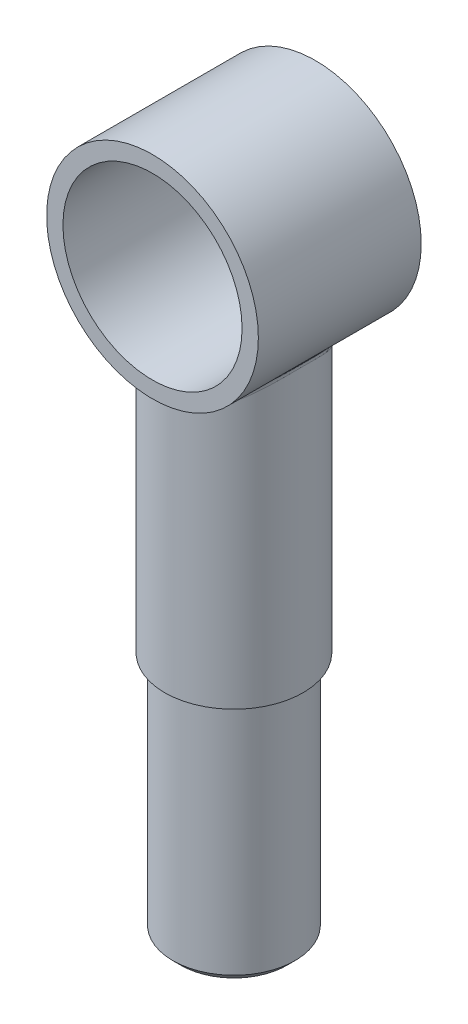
ISO-10303-21;
HEADER;
FILE_DESCRIPTION(('STEP AP214'),'2;1');
FILE_NAME('part.step','',(''),(''),'','','');
FILE_SCHEMA(('AUTOMOTIVE_DESIGN { 1 0 10303 214 1 1 1 1 }'));
ENDSEC;
DATA;
#1=APPLICATION_CONTEXT('core data for automotive mechanical design processes');
#2=APPLICATION_PROTOCOL_DEFINITION('international standard','automotive_design',2000,#1);
#3=PRODUCT_CONTEXT('',#1,'mechanical');
#4=PRODUCT('Part','Part','',(#3));
#5=PRODUCT_RELATED_PRODUCT_CATEGORY('part','',(#4));
#6=PRODUCT_DEFINITION_FORMATION('','',#4);
#7=PRODUCT_DEFINITION_CONTEXT('part definition',#1,'design');
#8=PRODUCT_DEFINITION('design','',#6,#7);
#9=PRODUCT_DEFINITION_SHAPE('','',#8);
#10=(LENGTH_UNIT() NAMED_UNIT(*) SI_UNIT(.MILLI.,.METRE.));
#11=(NAMED_UNIT(*) PLANE_ANGLE_UNIT() SI_UNIT($,.RADIAN.));
#12=(NAMED_UNIT(*) SI_UNIT($,.STERADIAN.) SOLID_ANGLE_UNIT());
#13=UNCERTAINTY_MEASURE_WITH_UNIT(LENGTH_MEASURE(1.E-05),#10,'distance_accuracy_value','');
#14=(GEOMETRIC_REPRESENTATION_CONTEXT(3) GLOBAL_UNCERTAINTY_ASSIGNED_CONTEXT((#13)) GLOBAL_UNIT_ASSIGNED_CONTEXT((#10,
#11,#12)) REPRESENTATION_CONTEXT('',''));
#15=CARTESIAN_POINT('',(0.,0.,0.));
#16=DIRECTION('',(0.,0.,1.));
#17=DIRECTION('',(1.,0.,0.));
#18=AXIS2_PLACEMENT_3D('',#15,#16,#17);
#19=CARTESIAN_POINT('',(0.,0.,10.));
#20=DIRECTION('',(0.,0.,-1.));
#21=DIRECTION('',(-1.,0.,0.));
#22=AXIS2_PLACEMENT_3D('',#19,#20,#21);
#23=CYLINDRICAL_SURFACE('',#22,13.);
#24=CARTESIAN_POINT('',(-2.72844377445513,-12.7104521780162,9.03417133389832));
#25=CARTESIAN_POINT('',(-2.45079467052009,-12.7700527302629,8.14117513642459));
#26=CARTESIAN_POINT('',(-2.62902679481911,-13.6881792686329,8.08320593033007));
#27=CARTESIAN_POINT('',(-2.53181586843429,-12.7526625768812,9.10304521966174));
#28=CARTESIAN_POINT('',(-2.26908647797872,-12.8045470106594,8.1956354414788));
#29=CARTESIAN_POINT('',(-2.43956346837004,-13.7336366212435,8.14482993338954));
#30=CARTESIAN_POINT('',(-2.33215641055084,-12.7907415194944,9.16473990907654));
#31=CARTESIAN_POINT('',(-2.0868247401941,-12.8351362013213,8.24363720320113));
#32=CARTESIAN_POINT('',(-2.24717905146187,-13.7746447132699,8.2000304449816));
#33=CARTESIAN_POINT('',(-1.92787348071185,-12.8578870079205,9.27306863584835));
#34=CARTESIAN_POINT('',(-1.71981066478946,-12.8887710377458,8.3275138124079));
#35=CARTESIAN_POINT('',(-1.8576270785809,-13.846955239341,8.29695614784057));
#36=CARTESIAN_POINT('',(-1.72325100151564,-12.8869553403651,9.319705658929));
#37=CARTESIAN_POINT('',(-1.53537328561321,-12.9117147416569,8.36322690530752));
#38=CARTESIAN_POINT('',(-1.660460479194,-13.8782595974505,8.33868401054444));
#39=CARTESIAN_POINT('',(-1.3104598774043,-12.9354496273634,9.39729817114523));
#40=CARTESIAN_POINT('',(-1.16479756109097,-12.94986130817,8.42247633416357));
#41=CARTESIAN_POINT('',(-1.26271032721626,-13.9304842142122,8.40810888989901));
#42=CARTESIAN_POINT('',(-1.10229353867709,-12.9548816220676,9.4282634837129));
#43=CARTESIAN_POINT('',(-0.979031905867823,-12.9649882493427,8.44589401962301));
#44=CARTESIAN_POINT('',(-1.06212899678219,-13.9514109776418,8.43581469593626));
#45=CARTESIAN_POINT('',(-0.683736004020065,-12.9837015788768,9.47412973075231));
#46=CARTESIAN_POINT('',(-0.606276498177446,-12.9874105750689,8.48057072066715));
#47=CARTESIAN_POINT('',(-0.658822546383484,-13.9824478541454,8.47685291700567));
#48=CARTESIAN_POINT('',(-0.473344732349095,-12.9930891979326,9.48903011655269));
#49=CARTESIAN_POINT('',(-0.41970003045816,-12.9946551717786,8.49175103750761));
#50=CARTESIAN_POINT('',(-0.45609735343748,-13.9925575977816,8.49018484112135));
#51=CARTESIAN_POINT('',(-0.0516215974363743,-13.0016104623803,9.50255700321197));
#52=CARTESIAN_POINT('',(-0.0456354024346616,-13.0012482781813,8.5019268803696));
#53=CARTESIAN_POINT('',(-0.0497406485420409,-14.0017343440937,8.50228784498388));
#54=CARTESIAN_POINT('',(0.159711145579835,-13.0007304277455,9.50116179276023));
#55=CARTESIAN_POINT('',(0.141417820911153,-13.0005709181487,8.50088248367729));
#56=CARTESIAN_POINT('',(0.153891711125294,-14.0007866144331,8.50103949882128));
#57=CARTESIAN_POINT('',(0.581520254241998,-12.9887015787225,9.48206233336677));
#58=CARTESIAN_POINT('',(0.51570130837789,-12.9912590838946,8.48650782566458));
#59=CARTESIAN_POINT('',(0.560331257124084,-13.987832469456,8.4839505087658));
#60=CARTESIAN_POINT('',(0.791996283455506,-12.9775490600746,9.46435220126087));
#61=CARTESIAN_POINT('',(0.702497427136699,-12.9826433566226,8.47320650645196));
#62=CARTESIAN_POINT('',(0.763138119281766,-13.9758220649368,8.46810460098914));
#63=CARTESIAN_POINT('',(1.21043923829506,-12.9452257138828,9.41287326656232));
#64=CARTESIAN_POINT('',(1.07556763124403,-12.957456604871,8.43423223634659));
#65=CARTESIAN_POINT('',(1.16633416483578,-13.9410123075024,8.4220445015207));
#66=CARTESIAN_POINT('',(1.41840644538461,-12.924056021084,9.37910628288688));
#67=CARTESIAN_POINT('',(1.26143215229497,-12.9409429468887,8.40864828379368));
#68=CARTESIAN_POINT('',(1.36672361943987,-13.9182141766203,8.39183193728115));
#69=CARTESIAN_POINT('',(1.83049201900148,-12.8721580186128,9.29596540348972));
#70=CARTESIAN_POINT('',(1.63201840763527,-12.9000214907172,8.3450248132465));
#71=CARTESIAN_POINT('',(1.76379392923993,-13.8623240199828,8.31744272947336));
#72=CARTESIAN_POINT('',(2.03460886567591,-12.8414260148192,9.24658547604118));
#73=CARTESIAN_POINT('',(1.81637502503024,-12.8756964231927,8.3071148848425));
#74=CARTESIAN_POINT('',(1.96047331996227,-13.8292280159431,8.27326068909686));
#75=CARTESIAN_POINT('',(2.43464054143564,-12.7715749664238,9.13369412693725));
#76=CARTESIAN_POINT('',(2.18036392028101,-12.8197253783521,8.21945786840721));
#77=CARTESIAN_POINT('',(2.34592894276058,-13.7540038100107,8.17225263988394));
#78=CARTESIAN_POINT('',(2.63063216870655,-12.7325872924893,9.07040352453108));
#79=CARTESIAN_POINT('',(2.35971171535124,-12.788299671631,8.17006390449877));
#80=CARTESIAN_POINT('',(2.53477917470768,-13.7120170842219,8.11562420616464));
#81=CARTESIAN_POINT('',(3.01654917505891,-12.646722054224,8.9299960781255));
#82=CARTESIAN_POINT('',(2.71557224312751,-12.7182228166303,8.05921496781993));
#83=CARTESIAN_POINT('',(2.9066344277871,-13.6195468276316,7.98999649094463));
#84=CARTESIAN_POINT('',(3.20647238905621,-12.5998417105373,8.85287436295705));
#85=CARTESIAN_POINT('',(2.89185923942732,-12.6796819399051,7.99793976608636));
#86=CARTESIAN_POINT('',(3.08963736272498,-13.5690603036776,7.9209928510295));
#87=CARTESIAN_POINT('',(3.76565609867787,-12.4486377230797,8.60193037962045));
#88=CARTESIAN_POINT('',(3.41249813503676,-12.5543995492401,7.79720207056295));
#89=CARTESIAN_POINT('',(3.62844595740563,-13.4062252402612,7.69646402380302));
#90=CARTESIAN_POINT('',(4.12462990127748,-12.3336969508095,8.40844344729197));
#91=CARTESIAN_POINT('',(3.75317022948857,-12.4573976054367,7.63992572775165));
#92=CARTESIAN_POINT('',(3.97433974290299,-13.2824428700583,7.52334413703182));
#93=CARTESIAN_POINT('',(4.84919217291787,-12.0686056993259,7.95026713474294));
#94=CARTESIAN_POINT('',(4.44997399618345,-12.2279886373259,7.25856423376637));
#95=CARTESIAN_POINT('',(4.67250096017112,-12.9969599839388,7.11339691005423));
#96=CARTESIAN_POINT('',(5.21072160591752,-11.915917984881,7.67992320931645));
#97=CARTESIAN_POINT('',(4.80403296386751,-12.0934321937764,7.03016309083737));
#98=CARTESIAN_POINT('',(5.02085725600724,-12.8325270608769,6.87151023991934));
#99=CARTESIAN_POINT('',(5.88926230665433,-11.595576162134,7.08848823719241));
#100=CARTESIAN_POINT('',(5.47615410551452,-11.8047250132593,6.51943492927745));
#101=CARTESIAN_POINT('',(5.67467380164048,-12.487543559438,6.34233158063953));
#102=CARTESIAN_POINT('',(6.206218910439,-11.4279040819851,6.76733588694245));
#103=CARTESIAN_POINT('',(5.79501393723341,-11.6510756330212,6.23845858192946));
#104=CARTESIAN_POINT('',(5.98008137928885,-12.3069736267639,6.05498474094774));
#105=CARTESIAN_POINT('',(6.67037946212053,-11.1599853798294,6.22269508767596));
#106=CARTESIAN_POINT('',(6.26746679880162,-11.4007063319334,5.75227860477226));
#107=CARTESIAN_POINT('',(6.42732919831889,-12.0184457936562,5.56767455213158));
#108=CARTESIAN_POINT('',(6.8334166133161,-11.0606547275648,6.01403415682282));
#109=CARTESIAN_POINT('',(6.43372835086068,-11.3075588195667,5.56568210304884));
#110=CARTESIAN_POINT('',(6.58442572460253,-11.911474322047,5.38097792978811));
#111=CARTESIAN_POINT('',(7.14259717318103,-10.8635565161,5.58185462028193));
#112=CARTESIAN_POINT('',(6.75009639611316,-11.1215452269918,5.1766928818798));
#113=CARTESIAN_POINT('',(6.88234059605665,-11.6992147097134,4.99429097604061));
#114=CARTESIAN_POINT('',(7.28874332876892,-10.7657887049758,5.3583384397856));
#115=CARTESIAN_POINT('',(6.90054487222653,-11.0285997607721,4.97435046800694));
#116=CARTESIAN_POINT('',(7.02316158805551,-11.593926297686,4.7943028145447));
#117=CARTESIAN_POINT('',(7.56327082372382,-10.5747285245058,4.89723139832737));
#118=CARTESIAN_POINT('',(7.18383298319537,-10.8460690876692,4.55475222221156));
#119=CARTESIAN_POINT('',(7.28768605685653,-11.3881691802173,4.38173335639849));
#120=CARTESIAN_POINT('',(7.6916708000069,-10.4814315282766,4.65965568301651));
#121=CARTESIAN_POINT('',(7.31704884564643,-10.7563444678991,4.33746790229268));
#122=CARTESIAN_POINT('',(7.41140749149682,-11.2876954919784,4.16916561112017));
#123=CARTESIAN_POINT('',(7.93005822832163,-10.302253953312,4.17058758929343));
#124=CARTESIAN_POINT('',(7.56473525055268,-10.5834386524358,3.88843421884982));
#125=CARTESIAN_POINT('',(7.64110873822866,-11.0947350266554,3.73157836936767));
#126=CARTESIAN_POINT('',(8.04002350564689,-10.2163823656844,3.91907892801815));
#127=CARTESIAN_POINT('',(7.67954750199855,-10.5000798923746,3.65651692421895));
#128=CARTESIAN_POINT('',(7.7470671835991,-11.0022579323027,3.50654430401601));
#129=CARTESIAN_POINT('',(8.2908249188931,-10.014970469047,3.27221830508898));
#130=CARTESIAN_POINT('',(7.9409503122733,-10.3045817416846,3.05961572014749));
#131=CARTESIAN_POINT('',(7.98873008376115,-10.7853528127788,2.9277742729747));
#132=CARTESIAN_POINT('',(8.41917741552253,-9.90636786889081,2.86840705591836));
#133=CARTESIAN_POINT('',(8.07613802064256,-10.1979197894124,2.68386165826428));
#134=CARTESIAN_POINT('',(8.11240576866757,-10.6683961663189,2.5664694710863));
#135=CARTESIAN_POINT('',(8.57384078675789,-9.77209807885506,2.24527163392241));
#136=CARTESIAN_POINT('',(8.23904582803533,-10.0658461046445,2.10177878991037));
#137=CARTESIAN_POINT('',(8.26143363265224,-10.5237979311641,2.00892725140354));
#138=CARTESIAN_POINT('',(8.61907528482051,-9.73212267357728,2.03473220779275));
#139=CARTESIAN_POINT('',(8.28669019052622,-10.0264968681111,1.9051551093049));
#140=CARTESIAN_POINT('',(8.30501991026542,-10.4807474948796,1.82054987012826));
#141=CARTESIAN_POINT('',(8.69633744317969,-9.66314690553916,1.60884891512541));
#142=CARTESIAN_POINT('',(8.36803180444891,-9.95860576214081,1.50719096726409));
#143=CARTESIAN_POINT('',(8.37946684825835,-10.4064658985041,1.43949639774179));
#144=CARTESIAN_POINT('',(8.72837193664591,-9.6341408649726,1.39350759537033));
#145=CARTESIAN_POINT('',(8.40183273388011,-9.92998071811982,1.30563730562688));
#146=CARTESIAN_POINT('',(8.410334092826,-10.3752286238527,1.2468225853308));
#147=CARTESIAN_POINT('',(8.77888389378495,-9.58813770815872,0.957641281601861));
#148=CARTESIAN_POINT('',(8.45508347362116,-9.88461019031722,0.897624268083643));
#149=CARTESIAN_POINT('',(8.45900553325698,-10.3256867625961,0.856836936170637));
#150=CARTESIAN_POINT('',(8.79724515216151,-9.57124357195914,0.737087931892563));
#151=CARTESIAN_POINT('',(8.47447869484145,-9.86790909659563,0.690882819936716));
#152=CARTESIAN_POINT('',(8.4766977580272,-10.3074930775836,0.65949972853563));
#153=CARTESIAN_POINT('',(8.81958824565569,-9.55065960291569,0.294506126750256));
#154=CARTESIAN_POINT('',(8.49805100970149,-9.84758442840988,0.276155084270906));
#155=CARTESIAN_POINT('',(8.49822673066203,-10.2853257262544,0.26350548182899));
#156=CARTESIAN_POINT('',(8.82357621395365,-9.5469641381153,0.0724783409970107));
#157=CARTESIAN_POINT('',(8.50226562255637,-9.84392856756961,0.0678984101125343));
#158=CARTESIAN_POINT('',(8.50206938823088,-10.281345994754,0.0648490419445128));
#159=CARTESIAN_POINT('',(8.81710052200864,-9.55294487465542,-0.371181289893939));
#160=CARTESIAN_POINT('',(8.49543258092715,-9.84983538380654,-0.347929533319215));
#161=CARTESIAN_POINT('',(8.49582965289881,-10.2877867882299,-0.33210957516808));
#162=CARTESIAN_POINT('',(8.80663274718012,-9.56262488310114,-0.592813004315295));
#163=CARTESIAN_POINT('',(8.48437151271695,-9.85940967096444,-0.555776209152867));
#164=CARTESIAN_POINT('',(8.48574329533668,-10.2982114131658,-0.530411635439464));
#165=CARTESIAN_POINT('',(8.77146172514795,-9.59489569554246,-1.0336627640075));
#166=CARTESIAN_POINT('',(8.44727512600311,-9.89126111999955,-0.968732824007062));
#167=CARTESIAN_POINT('',(8.4518538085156,-10.3329645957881,-0.924856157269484));
#168=CARTESIAN_POINT('',(8.7467574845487,-9.61748740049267,-1.25288063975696));
#169=CARTESIAN_POINT('',(8.42119045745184,-9.91358039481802,-1.17410684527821));
#170=CARTESIAN_POINT('',(8.4280497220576,-10.3572941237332,-1.1209984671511));
#171=CARTESIAN_POINT('',(8.68692901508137,-9.67154054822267,-1.66425804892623));
#172=CARTESIAN_POINT('',(8.35816125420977,-9.96683922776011,-1.55886635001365));
#173=CARTESIAN_POINT('',(8.37040123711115,-10.4155052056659,-1.48907299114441));
#174=CARTESIAN_POINT('',(8.6531774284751,-9.70181620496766,-1.85683428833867));
#175=CARTESIAN_POINT('',(8.32257993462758,-9.99668120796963,-1.73894344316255));
#176=CARTESIAN_POINT('',(8.33787946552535,-10.4481097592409,-1.66137804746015));
#177=CARTESIAN_POINT('',(8.57513255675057,-9.770865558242,-2.23770361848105));
#178=CARTESIAN_POINT('',(8.24046431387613,-10.0645809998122,-2.09454615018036));
#179=CARTESIAN_POINT('',(8.26267833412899,-10.5224706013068,-2.00215586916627));
#180=CARTESIAN_POINT('',(8.53083619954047,-9.80964173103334,-2.4259954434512));
#181=CARTESIAN_POINT('',(8.19384934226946,-10.1027022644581,-2.27022010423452));
#182=CARTESIAN_POINT('',(8.21999601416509,-10.5642295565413,-2.17062750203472));
#183=CARTESIAN_POINT('',(8.38280997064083,-9.93707485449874,-2.98344678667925));
#184=CARTESIAN_POINT('',(8.03804529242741,-10.2279255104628,-2.7904839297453));
#185=CARTESIAN_POINT('',(8.07736345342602,-10.7014652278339,-2.66939975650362));
#186=CARTESIAN_POINT('',(8.26394452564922,-10.0368349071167,-3.34517154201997));
#187=CARTESIAN_POINT('',(7.91302748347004,-10.3257446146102,-3.12673503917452));
#188=CARTESIAN_POINT('',(7.96282913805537,-10.8088991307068,-2.99304822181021));
#189=CARTESIAN_POINT('',(8.02697310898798,-10.2266363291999,-3.94976687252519));
#190=CARTESIAN_POINT('',(7.66593788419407,-10.5100265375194,-3.6848046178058));
#191=CARTESIAN_POINT('',(7.73449230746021,-11.0133006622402,-3.53400193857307));
#192=CARTESIAN_POINT('',(7.91732893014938,-10.312028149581,-4.19835646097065));
#193=CARTESIAN_POINT('',(7.5514916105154,-10.5928897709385,-3.9139659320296));
#194=CARTESIAN_POINT('',(7.6288432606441,-11.1052610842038,-3.75642420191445));
#195=CARTESIAN_POINT('',(7.67984785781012,-10.4900889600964,-4.68207976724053));
#196=CARTESIAN_POINT('',(7.30479670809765,-10.7646669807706,-4.35797748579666));
#197=CARTESIAN_POINT('',(7.40001534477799,-11.2970188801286,-4.18922926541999));
#198=CARTESIAN_POINT('',(7.55201182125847,-10.582757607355,-4.91721411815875));
#199=CARTESIAN_POINT('',(7.17219626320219,-10.8537585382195,-4.57296862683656));
#200=CARTESIAN_POINT('',(7.27683730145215,-11.3968158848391,-4.39961263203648));
#201=CARTESIAN_POINT('',(7.27882368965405,-10.7724833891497,-5.37383972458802));
#202=CARTESIAN_POINT('',(6.89034767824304,-11.0349605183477,-4.98837968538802));
#203=CARTESIAN_POINT('',(7.01360339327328,-11.6011359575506,-4.80817238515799));
#204=CARTESIAN_POINT('',(7.13344131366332,-10.8695479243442,-5.59530636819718));
#205=CARTESIAN_POINT('',(6.74072192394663,-11.1272070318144,-5.18881321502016));
#206=CARTESIAN_POINT('',(6.87351835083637,-11.7056669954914,-5.00632675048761));
#207=CARTESIAN_POINT('',(6.82614434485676,-11.0651270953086,-6.0235096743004));
#208=CARTESIAN_POINT('',(6.42632194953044,-11.3117525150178,-5.57415322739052));
#209=CARTESIAN_POINT('',(6.57741843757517,-11.9162907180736,-5.38945602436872));
#210=CARTESIAN_POINT('',(6.66423152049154,-11.1636415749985,-6.23024790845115));
#211=CARTESIAN_POINT('',(6.26121892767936,-11.4041278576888,-5.75901287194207));
#212=CARTESIAN_POINT('',(6.42140527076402,-12.0223832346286,-5.57443233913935));
#213=CARTESIAN_POINT('',(6.1497842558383,-11.4602571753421,-6.8328547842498));
#214=CARTESIAN_POINT('',(5.73654425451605,-11.6818290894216,-6.29798355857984));
#215=CARTESIAN_POINT('',(5.92570304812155,-12.341815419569,-6.11360691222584));
#216=CARTESIAN_POINT('',(5.77193549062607,-11.656959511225,-7.20543891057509));
#217=CARTESIAN_POINT('',(5.35682934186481,-11.8614455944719,-6.62272093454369));
#218=CARTESIAN_POINT('',(5.56162205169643,-12.5536487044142,-6.44697165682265));
#219=CARTESIAN_POINT('',(5.1599203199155,-11.9342251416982,-7.71026852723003));
#220=CARTESIAN_POINT('',(4.75789185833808,-12.1079119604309,-7.05291373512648));
#221=CARTESIAN_POINT('',(4.9719070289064,-12.8522424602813,-6.89866131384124));
#222=CARTESIAN_POINT('',(4.9483688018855,-12.0236844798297,-7.86954076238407));
#223=CARTESIAN_POINT('',(4.55087507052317,-12.1869870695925,-7.1879967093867));
#224=CARTESIAN_POINT('',(4.76806386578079,-12.9485832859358,-7.04116805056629));
#225=CARTESIAN_POINT('',(4.51081466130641,-12.1945699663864,-8.16881457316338));
#226=CARTESIAN_POINT('',(4.12659441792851,-12.3364672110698,-7.43956749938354));
#227=CARTESIAN_POINT('',(4.34645299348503,-13.1326138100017,-7.30893935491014));
#228=CARTESIAN_POINT('',(4.28482169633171,-12.2760013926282,-8.30882883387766));
#229=CARTESIAN_POINT('',(3.90933668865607,-12.4066902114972,-7.55569031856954));
#230=CARTESIAN_POINT('',(4.12869458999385,-13.2203091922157,-7.43421527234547));
#231=CARTESIAN_POINT('',(3.8468365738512,-12.4196854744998,-8.55275642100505));
#232=CARTESIAN_POINT('',(3.4926248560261,-12.5291647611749,-7.75596949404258));
#233=CARTESIAN_POINT('',(3.70666843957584,-13.3750458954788,-7.65246627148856));
#234=CARTESIAN_POINT('',(3.63631991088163,-12.4830673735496,-8.65897857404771));
#235=CARTESIAN_POINT('',(3.29389653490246,-12.5824756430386,-7.84211572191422));
#236=CARTESIAN_POINT('',(3.50382242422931,-13.4433033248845,-7.74750714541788));
#237=CARTESIAN_POINT('',(3.20599712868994,-12.6004470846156,-8.85395979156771));
#238=CARTESIAN_POINT('',(2.89100306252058,-12.6802997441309,-7.998992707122));
#239=CARTESIAN_POINT('',(3.08917941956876,-13.5697122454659,-7.92196402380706));
#240=CARTESIAN_POINT('',(2.98619583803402,-12.6544497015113,-8.94272780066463));
#241=CARTESIAN_POINT('',(2.68707715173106,-12.7246409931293,-8.06943297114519));
#242=CARTESIAN_POINT('',(2.87738708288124,-13.6278689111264,-8.00138803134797));
#243=CARTESIAN_POINT('',(2.53872185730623,-12.7517559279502,-9.10162186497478));
#244=CARTESIAN_POINT('',(2.27504503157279,-12.8038997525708,-8.19465234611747));
#245=CARTESIAN_POINT('',(2.4462178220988,-13.7326602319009,-8.1435564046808));
#246=CARTESIAN_POINT('',(2.31105490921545,-12.7950671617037,-9.17176120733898));
#247=CARTESIAN_POINT('',(2.06730036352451,-12.8386508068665,-8.24916115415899));
#248=CARTESIAN_POINT('',(2.22684643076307,-13.7793030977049,-8.20631265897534));
#249=CARTESIAN_POINT('',(1.84938010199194,-12.8699046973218,-9.29240414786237));
#250=CARTESIAN_POINT('',(1.64860351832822,-12.8983490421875,-8.34245754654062));
#251=CARTESIAN_POINT('',(1.78199378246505,-13.8598973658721,-8.31425634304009));
#252=CARTESIAN_POINT('',(1.61537301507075,-12.9014324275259,-9.34291012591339));
#253=CARTESIAN_POINT('',(1.43812589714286,-12.9231463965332,-8.38100778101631));
#254=CARTESIAN_POINT('',(1.55651326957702,-13.893850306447,-8.35944590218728));
#255=CARTESIAN_POINT('',(1.17149123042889,-12.9487939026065,-9.41858039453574));
#256=CARTESIAN_POINT('',(1.04059744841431,-12.9602816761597,-8.43861867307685));
#257=CARTESIAN_POINT('',(1.12880531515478,-13.9448549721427,-8.42715087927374));
#258=CARTESIAN_POINT('',(0.962107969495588,-12.9660613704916,-9.44606563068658));
#259=CARTESIAN_POINT('',(0.854075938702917,-12.9736911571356,-8.45935921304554));
#260=CARTESIAN_POINT('',(0.927051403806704,-13.9634507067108,-8.45174293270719));
#261=CARTESIAN_POINT('',(0.541374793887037,-12.9904318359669,-9.48481921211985));
#262=CARTESIAN_POINT('',(0.479860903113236,-12.992618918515,-8.48861268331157));
#263=CARTESIAN_POINT('',(0.521648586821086,-13.9896958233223,-8.4864171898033));
#264=CARTESIAN_POINT('',(0.330024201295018,-12.9975311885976,-9.4960817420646));
#265=CARTESIAN_POINT('',(0.292590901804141,-12.9980910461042,-8.49705418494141));
#266=CARTESIAN_POINT('',(0.317999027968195,-13.9973412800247,-8.4964941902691));
#267=CARTESIAN_POINT('',(-0.0929439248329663,-13.001387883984,-9.50220273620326));
#268=CARTESIAN_POINT('',(-0.0824625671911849,-13.0010737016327,-8.50165689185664));
#269=CARTESIAN_POINT('',(-0.0895573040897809,-14.0014946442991,-8.5019708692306));
#270=CARTESIAN_POINT('',(-0.304561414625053,-12.9981467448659,-9.49706360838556));
#271=CARTESIAN_POINT('',(-0.269806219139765,-12.9985784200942,-8.49780913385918));
#272=CARTESIAN_POINT('',(-0.293464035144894,-13.9980041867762,-8.49737270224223));
#273=CARTESIAN_POINT('',(-0.726410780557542,-12.9814047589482,-9.47046873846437));
#274=CARTESIAN_POINT('',(-0.644393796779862,-12.9856052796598,-8.4777754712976));
#275=CARTESIAN_POINT('',(-0.699942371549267,-13.9799743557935,-8.47357729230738));
#276=CARTESIAN_POINT('',(-0.936643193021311,-12.9679081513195,-9.44901973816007));
#277=CARTESIAN_POINT('',(-0.831205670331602,-12.9751607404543,-8.46164104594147));
#278=CARTESIAN_POINT('',(-0.902514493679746,-13.9654395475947,-8.45438608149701));
#279=CARTESIAN_POINT('',(-1.35394183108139,-12.9309956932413,-9.39016754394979));
#280=CARTESIAN_POINT('',(-1.20387900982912,-12.9463318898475,-8.41699178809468));
#281=CARTESIAN_POINT('',(-1.30460791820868,-13.9256876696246,-8.40172885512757));
#282=CARTESIAN_POINT('',(-1.56101255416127,-12.9075956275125,-9.35278973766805));
#283=CARTESIAN_POINT('',(-1.38933978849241,-12.9280240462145,-8.38859586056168));
#284=CARTESIAN_POINT('',(-1.50413355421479,-13.9004875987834,-8.36828555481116));
#285=CARTESIAN_POINT('',(-1.97089438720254,-12.8513956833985,-9.26259871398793));
#286=CARTESIAN_POINT('',(-1.75884616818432,-12.8835615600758,-8.31936738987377));
#287=CARTESIAN_POINT('',(-1.89908042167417,-13.8399645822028,-8.28758832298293));
#288=CARTESIAN_POINT('',(-2.17370601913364,-12.8185969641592,-9.20978740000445));
#289=CARTESIAN_POINT('',(-1.94254046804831,-12.8574991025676,-8.27867974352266));
#290=CARTESIAN_POINT('',(-2.09450215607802,-13.8046428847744,-8.24033609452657));
#291=CARTESIAN_POINT('',(-2.57388309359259,-12.7442745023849,-9.08937640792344));
#292=CARTESIAN_POINT('',(-2.30772903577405,-12.797703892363,-8.18484192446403));
#293=CARTESIAN_POINT('',(-2.48009787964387,-13.7246033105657,-8.13259994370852));
#294=CARTESIAN_POINT('',(-2.77124812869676,-12.7027501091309,-9.0217756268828));
#295=CARTESIAN_POINT('',(-2.48893431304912,-12.7640807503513,-8.13186706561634));
#296=CARTESIAN_POINT('',(-2.67027147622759,-13.6798847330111,-8.07211503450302));
#297=CARTESIAN_POINT('',(-3.15953377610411,-12.6117877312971,-8.87253306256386));
#298=CARTESIAN_POINT('',(-2.84822960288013,-12.6894873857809,-8.01353058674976));
#299=CARTESIAN_POINT('',(-3.04440906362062,-13.581925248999,-7.93858221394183));
#300=CARTESIAN_POINT('',(-3.35045094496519,-12.5623455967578,-8.79088391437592));
#301=CARTESIAN_POINT('',(-3.02610137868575,-12.648632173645,-7.94835779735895));
#302=CARTESIAN_POINT('',(-3.22836973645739,-13.5286798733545,-7.86552771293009));
#303=CARTESIAN_POINT('',(-3.92545576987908,-12.3997098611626,-8.51977137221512));
#304=CARTESIAN_POINT('',(-3.56322730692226,-12.513237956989,-7.73056904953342));
#305=CARTESIAN_POINT('',(-3.78242296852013,-13.3535336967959,-7.62295333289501));
#306=CARTESIAN_POINT('',(-4.29760483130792,-12.2749182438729,-8.3084423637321));
#307=CARTESIAN_POINT('',(-3.91810852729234,-12.4072680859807,-7.55785031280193));
#308=CARTESIAN_POINT('',(-4.14101194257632,-13.2191427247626,-7.43386948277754));
#309=CARTESIAN_POINT('',(-5.00495726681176,-12.0039272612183,-7.83580725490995));
#310=CARTESIAN_POINT('',(-4.60259156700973,-12.1708400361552,-7.16150023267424));
#311=CARTESIAN_POINT('',(-4.8225904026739,-12.9273062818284,-7.01098543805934));
#312=CARTESIAN_POINT('',(-5.34012655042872,-11.857708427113,-7.57445563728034));
#313=CARTESIAN_POINT('',(-4.9320892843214,-12.0411712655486,-6.9394158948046));
#314=CARTESIAN_POINT('',(-5.1455470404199,-12.7698398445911,-6.77714451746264));
#315=CARTESIAN_POINT('',(-5.83841785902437,-11.6169883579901,-7.12623276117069));
#316=CARTESIAN_POINT('',(-5.42942714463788,-11.8223784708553,-6.54917860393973));
#317=CARTESIAN_POINT('',(-5.62568198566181,-12.5106028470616,-6.37610299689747));
#318=CARTESIAN_POINT('',(-6.01491862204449,-11.5264007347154,-6.95385967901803));
#319=CARTESIAN_POINT('',(-5.60603927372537,-11.7396961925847,-6.39870911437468));
#320=CARTESIAN_POINT('',(-5.79575154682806,-12.4130469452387,-6.22187444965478));
#321=CARTESIAN_POINT('',(-6.35373906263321,-11.3431490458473,-6.59513015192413));
#322=CARTESIAN_POINT('',(-5.94678426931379,-11.5709787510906,-6.08292507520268));
#323=CARTESIAN_POINT('',(-6.12222630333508,-12.215698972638,-5.90090592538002));
#324=CARTESIAN_POINT('',(-6.51607131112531,-11.2504869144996,-6.40878638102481));
#325=CARTESIAN_POINT('',(-6.1111413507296,-11.4849697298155,-5.91778276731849));
#326=CARTESIAN_POINT('',(-6.27864361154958,-12.1159089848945,-5.73417728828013));
#327=CARTESIAN_POINT('',(-6.82643029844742,-11.064925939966,-6.02247302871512));
#328=CARTESIAN_POINT('',(-6.42662579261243,-11.3114994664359,-5.57301782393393));
#329=CARTESIAN_POINT('',(-6.5776939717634,-11.9160740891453,-5.38852849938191));
#330=CARTESIAN_POINT('',(-6.97444031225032,-10.9720269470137,-5.82248797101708));
#331=CARTESIAN_POINT('',(-6.5780006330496,-11.2240043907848,-5.39346378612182));
#332=CARTESIAN_POINT('',(-6.72031090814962,-11.816029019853,-5.20959450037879));
#333=CARTESIAN_POINT('',(-7.2554748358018,-10.7882468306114,-5.40956277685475));
#334=CARTESIAN_POINT('',(-6.8662871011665,-11.0499352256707,-5.02060061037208));
#335=CARTESIAN_POINT('',(-6.9911053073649,-11.6181119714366,-4.8401351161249));
#336=CARTESIAN_POINT('',(-7.3884969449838,-10.6973660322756,-5.19662057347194));
#337=CARTESIAN_POINT('',(-7.00348349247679,-10.963281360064,-4.82730614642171));
#338=CARTESIAN_POINT('',(-7.11928045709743,-11.5202403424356,-4.649607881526));
#339=CARTESIAN_POINT('',(-7.62884880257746,-10.5271357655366,-4.77583256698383));
#340=CARTESIAN_POINT('',(-7.25201251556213,-10.8001979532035,-4.44343180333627));
#341=CARTESIAN_POINT('',(-7.35087455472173,-11.3369154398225,-4.27311334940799));
#342=CARTESIAN_POINT('',(-7.73738301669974,-10.4474457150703,-4.56894464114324));
#343=CARTESIAN_POINT('',(-7.36467924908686,-10.723471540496,-4.25398398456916));
#344=CARTESIAN_POINT('',(-7.45545408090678,-11.2510953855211,-4.08800309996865));
#345=CARTESIAN_POINT('',(-7.94056249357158,-10.2938663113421,-4.14498246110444));
#346=CARTESIAN_POINT('',(-7.57588431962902,-10.5751615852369,-3.86447097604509));
#347=CARTESIAN_POINT('',(-7.65123025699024,-11.0857021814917,-3.70866851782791));
#348=CARTESIAN_POINT('',(-8.03520827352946,-10.2199767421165,-3.9279085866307));
#349=CARTESIAN_POINT('',(-7.67465528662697,-10.5034576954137,-3.66430684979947));
#350=CARTESIAN_POINT('',(-7.74242740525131,-11.0061287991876,-3.51444452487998));
#351=CARTESIAN_POINT('',(-8.20968954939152,-10.0803507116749,-3.48439758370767));
#352=CARTESIAN_POINT('',(-7.85687962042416,-10.3676835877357,-3.25430854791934));
#353=CARTESIAN_POINT('',(-7.91055106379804,-10.8557623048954,-3.11761889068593));
#354=CARTESIAN_POINT('',(-8.2895459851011,-10.0146027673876,-3.25797425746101));
#355=CARTESIAN_POINT('',(-7.94057624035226,-10.3034668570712,-3.04433266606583));
#356=CARTESIAN_POINT('',(-7.98749775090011,-10.7849568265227,-2.91502959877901));
#357=CARTESIAN_POINT('',(-8.43365041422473,-9.89355390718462,-2.79631740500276));
#358=CARTESIAN_POINT('',(-8.09163560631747,-10.1851009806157,-2.61544345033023));
#359=CARTESIAN_POINT('',(-8.12635141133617,-10.6545965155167,-2.5019682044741));
#360=CARTESIAN_POINT('',(-8.49790373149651,-9.83824942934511,-2.56108691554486));
#361=CARTESIAN_POINT('',(-8.15920760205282,-10.1308065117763,-2.39631349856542));
#362=CARTESIAN_POINT('',(-8.18826351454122,-10.5950378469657,-2.29149881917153));
#363=CARTESIAN_POINT('',(-8.59910249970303,-9.74982295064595,-2.12874861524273));
#364=CARTESIAN_POINT('',(-8.2656460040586,-10.0439251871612,-1.99293795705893));
#365=CARTESIAN_POINT('',(-8.28577487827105,-10.4998093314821,-1.90466981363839));
#366=CARTESIAN_POINT('',(-8.63891991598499,-9.71448158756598,-1.93294434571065));
#367=CARTESIAN_POINT('',(-8.30759212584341,-10.0091275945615,-1.81001750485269));
#368=CARTESIAN_POINT('',(-8.32414145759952,-10.4617494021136,-1.72947651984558));
#369=CARTESIAN_POINT('',(-8.70714585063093,-9.65337844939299,-1.53742428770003));
#370=CARTESIAN_POINT('',(-8.37943699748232,-9.94896629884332,-1.4403252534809));
#371=CARTESIAN_POINT('',(-8.38988142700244,-10.3959460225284,-1.37559015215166));
#372=CARTESIAN_POINT('',(-8.73556088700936,-9.62761120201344,-1.33771080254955));
#373=CARTESIAN_POINT('',(-8.40941633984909,-9.92353751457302,-1.25338078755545));
#374=CARTESIAN_POINT('',(-8.41726109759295,-10.3681966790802,-1.19689913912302));
#375=CARTESIAN_POINT('',(-8.78055101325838,-9.58659770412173,-0.935651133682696));
#376=CARTESIAN_POINT('',(-8.45684923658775,-9.88308328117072,-0.876976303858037));
#377=CARTESIAN_POINT('',(-8.46061190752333,-10.3240282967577,-0.837161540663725));
#378=CARTESIAN_POINT('',(-8.79713551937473,-9.57134308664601,-0.733307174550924));
#379=CARTESIAN_POINT('',(-8.47436374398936,-9.86800664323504,-0.687322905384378));
#380=CARTESIAN_POINT('',(-8.47659212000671,-10.3076002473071,-0.656116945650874));
#381=CARTESIAN_POINT('',(-8.81821421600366,-9.55192686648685,-0.327263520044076));
#382=CARTESIAN_POINT('',(-8.49660198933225,-9.84883530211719,-0.306839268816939));
#383=CARTESIAN_POINT('',(-8.49690276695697,-10.2866904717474,-0.292814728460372));
#384=CARTESIAN_POINT('',(-8.82270825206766,-9.54776540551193,-0.123563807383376));
#385=CARTESIAN_POINT('',(-8.5013502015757,-9.84471954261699,-0.115799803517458));
#386=CARTESIAN_POINT('',(-8.50123305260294,-10.2822088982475,-0.110557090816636));
#387=CARTESIAN_POINT('',(-8.81952121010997,-9.55070939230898,0.283832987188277));
#388=CARTESIAN_POINT('',(-8.49798721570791,-9.84762721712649,0.266046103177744));
#389=CARTESIAN_POINT('',(-8.49816213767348,-10.2853793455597,0.253955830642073));
#390=CARTESIAN_POINT('',(-8.81182796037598,-9.55782610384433,0.487529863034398));
#391=CARTESIAN_POINT('',(-8.48985939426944,-9.85466504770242,0.457065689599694));
#392=CARTESIAN_POINT('',(-8.49074920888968,-10.2930434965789,0.43621093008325));
#393=CARTESIAN_POINT('',(-8.78438421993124,-9.58305467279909,0.893169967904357));
#394=CARTESIAN_POINT('',(-8.46090974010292,-9.87957046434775,0.837104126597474));
#395=CARTESIAN_POINT('',(-8.46430544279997,-10.320212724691,0.799152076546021));
#396=CARTESIAN_POINT('',(-8.76463382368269,-9.60116644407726,1.09511321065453));
#397=CARTESIAN_POINT('',(-8.44005605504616,-9.89746533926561,1.0263301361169));
#398=CARTESIAN_POINT('',(-8.44527469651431,-10.3397177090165,0.979838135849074));
#399=CARTESIAN_POINT('',(-8.71338540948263,-9.64769959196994,1.49605678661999));
#400=CARTESIAN_POINT('',(-8.38603928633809,-9.94334553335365,1.40155650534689));
#401=CARTESIAN_POINT('',(-8.39589363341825,-10.3898303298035,1.33857712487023));
#402=CARTESIAN_POINT('',(-8.68187586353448,-9.67613108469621,1.69505403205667));
#403=CARTESIAN_POINT('',(-8.35280647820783,-9.97138885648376,1.58774495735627));
#404=CARTESIAN_POINT('',(-8.36553220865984,-10.4204488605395,1.51662729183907));
#405=CARTESIAN_POINT('',(-8.60756914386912,-9.74229035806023,2.08884044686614));
#406=CARTESIAN_POINT('',(-8.27458954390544,-10.0364888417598,1.95561889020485));
#407=CARTESIAN_POINT('',(-8.29393302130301,-10.4916973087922,1.86896250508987));
#408=CARTESIAN_POINT('',(-8.56476619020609,-9.7800228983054,2.28362740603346));
#409=CARTESIAN_POINT('',(-8.22952009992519,-10.0736135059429,2.13747131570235));
#410=CARTESIAN_POINT('',(-8.252689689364,-10.5323323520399,2.04324557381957));
#411=CARTESIAN_POINT('',(-8.45565494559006,-9.87463427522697,2.71891637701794));
#412=CARTESIAN_POINT('',(-8.11481110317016,-10.1665038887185,2.54334216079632));
#413=CARTESIAN_POINT('',(-8.14755415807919,-10.6342215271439,2.43271465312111));
#414=CARTESIAN_POINT('',(-8.3861238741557,-9.93393741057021,2.95787436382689));
#415=CARTESIAN_POINT('',(-8.04173380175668,-10.2246670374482,2.7657458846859));
#416=CARTESIAN_POINT('',(-8.08055660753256,-10.6980864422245,2.64651916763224));
#417=CARTESIAN_POINT('',(-8.2309242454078,-10.0629051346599,3.42639232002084));
#418=CARTESIAN_POINT('',(-7.87917475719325,-10.3506240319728,3.20054230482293));
#419=CARTESIAN_POINT('',(-7.93101202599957,-10.8369747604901,3.06571944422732));
#420=CARTESIAN_POINT('',(-8.14524460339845,-10.132576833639,3.65594570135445));
#421=CARTESIAN_POINT('',(-7.78945705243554,-10.4185767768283,3.41314740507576));
#422=CARTESIAN_POINT('',(-7.84845431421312,-10.9120058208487,3.27110931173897));
#423=CARTESIAN_POINT('',(-7.95865711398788,-10.2797809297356,4.1049837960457));
#424=CARTESIAN_POINT('',(-7.59481128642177,-10.5614760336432,3.82762804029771));
#425=CARTESIAN_POINT('',(-7.66866555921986,-11.0705333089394,3.67288023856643));
#426=CARTESIAN_POINT('',(-7.8577347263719,-10.3573208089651,4.32445863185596));
#427=CARTESIAN_POINT('',(-7.48962615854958,-10.6365719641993,4.02964481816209));
#428=CARTESIAN_POINT('',(-7.5714205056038,-11.1540377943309,3.86925246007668));
#429=CARTESIAN_POINT('',(-7.64157653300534,-10.5178163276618,4.75252464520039));
#430=CARTESIAN_POINT('',(-7.26527228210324,-10.7912174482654,4.42214628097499));
#431=CARTESIAN_POINT('',(-7.36313852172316,-11.326879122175,4.25225889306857));
#432=CARTESIAN_POINT('',(-7.5263433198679,-10.6007709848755,4.96111778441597));
#433=CARTESIAN_POINT('',(-7.14585611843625,-10.8708882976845,4.61272194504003));
#434=CARTESIAN_POINT('',(-7.25210408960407,-11.4162149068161,4.43889485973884));
#435=CARTESIAN_POINT('',(-7.15524540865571,-10.857899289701,5.57821033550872));
#436=CARTESIAN_POINT('',(-6.76093647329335,-11.1177278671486,5.17704763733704));
#437=CARTESIAN_POINT('',(-6.89452796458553,-11.6931223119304,4.99103030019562));
#438=CARTESIAN_POINT('',(-6.87763073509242,-11.0373232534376,5.969303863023));
#439=CARTESIAN_POINT('',(-6.47525974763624,-11.2876382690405,5.52926595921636));
#440=CARTESIAN_POINT('',(-6.62702880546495,-11.8863481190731,5.34095608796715));
#441=CARTESIAN_POINT('',(-6.26906285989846,-11.3940041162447,6.70159456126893));
#442=CARTESIAN_POINT('',(-5.85790882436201,-11.6201131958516,6.18112570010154));
#443=CARTESIAN_POINT('',(-6.04063546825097,-12.2704659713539,5.99616355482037));
#444=CARTESIAN_POINT('',(-5.93808952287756,-11.5712601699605,7.04277280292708));
#445=CARTESIAN_POINT('',(-5.52441810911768,-11.7828078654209,6.48001420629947));
#446=CARTESIAN_POINT('',(-5.72172188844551,-12.4613571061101,6.30142829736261));
#447=CARTESIAN_POINT('',(-5.37531820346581,-11.8388606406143,7.53807421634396));
#448=CARTESIAN_POINT('',(-4.96963166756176,-12.0229244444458,6.90576977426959));
#449=CARTESIAN_POINT('',(-5.17945640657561,-12.7495422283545,6.74459271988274));
#450=CARTESIAN_POINT('',(-5.15994448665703,-11.9345457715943,7.71074639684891));
#451=CARTESIAN_POINT('',(-4.75765612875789,-12.1081853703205,7.05327018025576));
#452=CARTESIAN_POINT('',(-4.9719303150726,-12.8525877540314,6.89908888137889));
#453=CARTESIAN_POINT('',(-4.71314875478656,-12.1179391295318,8.03563815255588));
#454=CARTESIAN_POINT('',(-4.32202246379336,-12.269845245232,7.328276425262));
#455=CARTESIAN_POINT('',(-4.54141458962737,-13.0500882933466,7.18978150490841));
#456=CARTESIAN_POINT('',(-4.48173394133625,-12.2056508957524,8.18786681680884));
#457=CARTESIAN_POINT('',(-4.09831710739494,-12.3460551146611,7.45538360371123));
#458=CARTESIAN_POINT('',(-4.31843189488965,-13.1445471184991,7.32598609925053));
#459=CARTESIAN_POINT('',(-4.00420802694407,-12.3705324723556,8.46998536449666));
#460=CARTESIAN_POINT('',(-3.64126041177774,-12.487718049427,7.68870894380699));
#461=CARTESIAN_POINT('',(-3.85830571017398,-13.3221118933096,7.57840795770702));
#462=CARTESIAN_POINT('',(-3.75811259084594,-12.4477132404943,8.59989850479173));
#463=CARTESIAN_POINT('',(-3.40805723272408,-12.5529269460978,7.79447920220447));
#464=CARTESIAN_POINT('',(-3.62117731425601,-13.405229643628,7.69464603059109));
#465=CARTESIAN_POINT('',(-3.25265588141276,-12.5892419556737,8.83560030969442));
#466=CARTESIAN_POINT('',(-2.93376595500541,-12.6712430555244,7.98465150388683));
#467=CARTESIAN_POINT('',(-3.13413805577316,-13.5576451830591,7.90553711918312));
#468=CARTESIAN_POINT('',(-2.99330003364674,-12.6535950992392,8.94139874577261));
#469=CARTESIAN_POINT('',(-2.6930454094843,-12.7240654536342,8.06856944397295));
#470=CARTESIAN_POINT('',(-2.88423242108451,-13.6269485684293,8.00019887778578));
#471=CARTESIAN_POINT('',(-2.72844377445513,-12.7104521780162,9.03417133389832));
#472=CARTESIAN_POINT('',(-2.45079467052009,-12.7700527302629,8.14117513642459));
#473=CARTESIAN_POINT('',(-2.62902679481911,-13.6881792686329,8.08320593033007));
#474=(BOUNDED_SURFACE() B_SPLINE_SURFACE(3,2,((#24,#25,#26),(#27,#28,#29),(#30,#31,#32),(#33,
#34,#35),(#36,#37,#38),(#39,#40,#41),(#42,#43,#44),(#45,#46,#47),(#48,#49,#50),(#51,#52,#53),
(#54,#55,#56),(#57,#58,#59),(#60,#61,#62),(#63,#64,#65),(#66,#67,#68),(#69,#70,#71),(#72,#73,
#74),(#75,#76,#77),(#78,#79,#80),(#81,#82,#83),(#84,#85,#86),(#87,#88,#89),(#90,#91,#92),(#93,
#94,#95),(#96,#97,#98),(#99,#100,#101),(#102,#103,#104),(#105,#106,#107),(#108,#109,#110),(#111,
#112,#113),(#114,#115,#116),(#117,#118,#119),(#120,#121,#122),(#123,#124,#125),(#126,#127,#128),
(#129,#130,#131),(#132,#133,#134),(#135,#136,#137),(#138,#139,#140),(#141,#142,#143),(#144,#145,
#146),(#147,#148,#149),(#150,#151,#152),(#153,#154,#155),(#156,#157,#158),(#159,#160,#161),
(#162,#163,#164),(#165,#166,#167),(#168,#169,#170),(#171,#172,#173),(#174,#175,#176),(#177,#178,
#179),(#180,#181,#182),(#183,#184,#185),(#186,#187,#188),(#189,#190,#191),(#192,#193,#194),
(#195,#196,#197),(#198,#199,#200),(#201,#202,#203),(#204,#205,#206),(#207,#208,#209),(#210,#211,
#212),(#213,#214,#215),(#216,#217,#218),(#219,#220,#221),(#222,#223,#224),(#225,#226,#227),
(#228,#229,#230),(#231,#232,#233),(#234,#235,#236),(#237,#238,#239),(#240,#241,#242),(#243,#244,
#245),(#246,#247,#248),(#249,#250,#251),(#252,#253,#254),(#255,#256,#257),(#258,#259,#260),
(#261,#262,#263),(#264,#265,#266),(#267,#268,#269),(#270,#271,#272),(#273,#274,#275),(#276,#277,
#278),(#279,#280,#281),(#282,#283,#284),(#285,#286,#287),(#288,#289,#290),(#291,#292,#293),
(#294,#295,#296),(#297,#298,#299),(#300,#301,#302),(#303,#304,#305),(#306,#307,#308),(#309,#310,
#311),(#312,#313,#314),(#315,#316,#317),(#318,#319,#320),(#321,#322,#323),(#324,#325,#326),
(#327,#328,#329),(#330,#331,#332),(#333,#334,#335),(#336,#337,#338),(#339,#340,#341),(#342,#343,
#344),(#345,#346,#347),(#348,#349,#350),(#351,#352,#353),(#354,#355,#356),(#357,#358,#359),
(#360,#361,#362),(#363,#364,#365),(#366,#367,#368),(#369,#370,#371),(#372,#373,#374),(#375,#376,
#377),(#378,#379,#380),(#381,#382,#383),(#384,#385,#386),(#387,#388,#389),(#390,#391,#392),
(#393,#394,#395),(#396,#397,#398),(#399,#400,#401),(#402,#403,#404),(#405,#406,#407),(#408,#409,
#410),(#411,#412,#413),(#414,#415,#416),(#417,#418,#419),(#420,#421,#422),(#423,#424,#425),
(#426,#427,#428),(#429,#430,#431),(#432,#433,#434),(#435,#436,#437),(#438,#439,#440),(#441,#442,
#443),(#444,#445,#446),(#447,#448,#449),(#450,#451,#452),(#453,#454,#455),(#456,#457,#458),
(#459,#460,#461),(#462,#463,#464),(#465,#466,#467),(#468,#469,#470),(#471,#472,#473)),
.UNSPECIFIED.,.T.,.F.,.F.) B_SPLINE_SURFACE_WITH_KNOTS((4,2,2,2,2,2,2,2,2,2,2,2,2,2,2,2,2,2,2,2,
2,2,2,2,2,2,2,2,2,2,2,2,2,2,2,2,2,2,2,2,2,2,2,2,2,2,2,2,2,2,2,2,2,2,2,2,2,2,2,2,2,2,2,2,2,2,2,2,
2,2,2,2,2,2,4),(3,3),(0.,0.681559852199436,1.36298447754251,2.0439814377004,2.72500165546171,
3.40692932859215,4.08910300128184,4.77119941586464,5.45355966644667,6.12578349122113,
6.79824453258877,8.14216161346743,9.64190269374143,11.1434673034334,12.0214598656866,
12.8993094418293,13.7762299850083,14.6541979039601,15.9758627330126,16.6362406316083,
17.2962762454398,17.9618592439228,18.6271581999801,19.2926465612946,19.9581813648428,
20.5535716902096,21.1491356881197,22.3402960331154,23.2098137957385,24.079290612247,
24.9502899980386,25.8211963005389,27.5845544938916,28.4662797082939,29.3474213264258,
30.125018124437,30.9022153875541,31.6788568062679,32.4554040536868,33.1383401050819,
33.8215209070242,34.5046014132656,35.1873997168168,35.8691138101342,36.5507438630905,
37.2324247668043,37.9144641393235,39.3264437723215,40.7397143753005,41.5625661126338,
42.3846801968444,43.2077430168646,44.0309374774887,44.788198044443,45.5454304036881,
46.3015822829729,47.0574757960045,47.6689420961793,48.2800583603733,48.8906876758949,
49.5013247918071,50.1125721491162,50.7238147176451,51.3356580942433,51.9478152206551,
52.721976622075,53.4966713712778,54.2721098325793,55.0474080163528,56.6280013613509,
58.209192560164,59.1289955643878,60.0483882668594,60.966816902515,61.8848727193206),(0.,1.),
.UNSPECIFIED.) GEOMETRIC_REPRESENTATION_ITEM() RATIONAL_B_SPLINE_SURFACE(((1.,0.729696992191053,
1.),(1.,0.726491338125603,1.),(1.,0.723562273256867,1.),(1.,0.7183548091,1.),(1.,
0.716076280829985,1.),(1.,0.712253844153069,1.),(1.,0.710709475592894,1.),(1.,0.708412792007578,
1.),(1.,0.707660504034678,1.),(1.,0.706977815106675,1.),(1.,0.707048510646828,1.),(1.,
0.708011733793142,1.),(1.,0.708904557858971,1.),(1.,0.711476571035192,1.),(1.,0.713155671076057,
1.),(1.,0.717236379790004,1.),(1.,0.719638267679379,1.),(1.,0.725037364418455,1.),(1.,
0.728025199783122,1.),(1.,0.734521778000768,1.),(1.,0.738030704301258,1.),(1.,0.749183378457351,
1.),(1.,0.757457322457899,1.),(1.,0.775873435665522,1.),(1.,0.786120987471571,1.),(1.,
0.806736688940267,1.),(1.,0.817104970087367,1.),(1.,0.833007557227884,1.),(1.,0.838761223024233,
1.),(1.,0.84991775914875,1.),(1.,0.855320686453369,1.),(1.,0.865650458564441,1.),(1.,
0.870577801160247,1.),(1.,0.879853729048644,1.),(1.,0.884201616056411,1.),(1.,0.894222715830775,
1.),(1.,0.899455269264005,1.),(1.,0.905815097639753,1.),(1.,0.907686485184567,1.),(1.,
0.910893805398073,1.),(1.,0.912230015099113,1.),(1.,0.914340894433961,1.),(1.,0.915110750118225,
1.),(1.,0.916047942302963,1.),(1.,0.916215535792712,1.),(1.,0.915943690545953,1.),(1.,
0.915504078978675,1.),(1.,0.9140307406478,1.),(1.,0.912996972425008,1.),(1.,0.910503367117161,
1.),(1.,0.909099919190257,1.),(1.,0.905869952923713,1.),(1.,0.904043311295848,1.),(1.,
0.89797446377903,1.),(1.,0.893143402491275,1.),(1.,0.883684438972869,1.),(1.,0.879353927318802,
1.),(1.,0.87012274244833,1.),(1.,0.865222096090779,1.),(1.,0.854952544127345,1.),(1.,
0.849582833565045,1.),(1.,0.838503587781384,1.),(1.,0.83279408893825,1.),(1.,0.815177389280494,
1.),(1.,0.802914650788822,1.),(1.,0.784818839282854,1.),(1.,0.77883646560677,1.),(1.,
0.767163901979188,1.),(1.,0.761473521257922,1.),(1.,0.75123861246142,1.),(1.,0.746638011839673,
1.),(1.,0.737991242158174,1.),(1.,0.733944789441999,1.),(1.,0.726564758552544,1.),(1.,
0.723230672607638,1.),(1.,0.717417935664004,1.),(1.,0.71493918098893,1.),(1.,0.711195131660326,
1.),(1.,0.709819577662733,1.),(1.,0.707874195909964,1.),(1.,0.707304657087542,1.),(1.,
0.70699554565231,1.),(1.,0.707255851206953,1.),(1.,0.70859522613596,1.),(1.,0.709673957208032,
1.),(1.,0.712604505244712,1.),(1.,0.714455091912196,1.),(1.,0.718858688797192,1.),(1.,
0.721411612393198,1.),(1.,0.727130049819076,1.),(1.,0.730295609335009,1.),(1.,0.737137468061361,
1.),(1.,0.740814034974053,1.),(1.,0.752724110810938,1.),(1.,0.761623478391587,1.),(1.,
0.780227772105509,1.),(1.,0.789933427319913,1.),(1.,0.805298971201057,1.),(1.,0.81095512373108,
1.),(1.,0.822143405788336,1.),(1.,0.82767564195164,1.),(1.,0.838511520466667,1.),(1.,
0.84381489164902,1.),(1.,0.854084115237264,1.),(1.,0.859049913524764,1.),(1.,0.868165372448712,
1.),(1.,0.87234854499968,1.),(1.,0.880272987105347,1.),(1.,0.884014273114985,1.),(1.,
0.890976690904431,1.),(1.,0.894198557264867,1.),(1.,0.900054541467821,1.),(1.,0.902688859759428,
1.),(1.,0.906859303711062,1.),(1.,0.908509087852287,1.),(1.,0.911344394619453,1.),(1.,
0.912530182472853,1.),(1.,0.914410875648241,1.),(1.,0.915106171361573,1.),(1.,0.915990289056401,
1.),(1.,0.916179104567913,1.),(1.,0.916045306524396,1.),(1.,0.91572218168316,1.),(1.,
0.914571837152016,1.),(1.,0.913744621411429,1.),(1.,0.911605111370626,1.),(1.,0.910292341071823,
1.),(1.,0.907210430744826,1.),(1.,0.905441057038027,1.),(1.,0.900956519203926,1.),(1.,
0.898114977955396,1.),(1.,0.891833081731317,1.),(1.,0.888392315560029,1.),(1.,0.880987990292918,
1.),(1.,0.877023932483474,1.),(1.,0.868656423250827,1.),(1.,0.864253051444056,1.),(1.,
0.850316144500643,1.),(1.,0.840204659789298,1.),(1.,0.819182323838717,1.),(1.,0.808271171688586,
1.),(1.,0.791095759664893,1.),(1.,0.784796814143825,1.),(1.,0.772445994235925,1.),(1.,
0.766394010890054,1.),(1.,0.75477980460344,1.),(1.,0.749217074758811,1.),(1.,0.738834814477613,
1.),(1.,0.734014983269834,1.),(1.,0.729696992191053,1.))) REPRESENTATION_ITEM('') SURFACE());
#475=CARTESIAN_POINT('',(-2.72844377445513,-12.7104521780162,9.03417133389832));
#476=CARTESIAN_POINT('',(-2.53181586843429,-12.7526625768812,9.10304521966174));
#477=CARTESIAN_POINT('',(-2.33215641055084,-12.7907415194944,9.16473990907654));
#478=CARTESIAN_POINT('',(-1.92787348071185,-12.8578870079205,9.27306863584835));
#479=CARTESIAN_POINT('',(-1.72325100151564,-12.8869553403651,9.319705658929));
#480=CARTESIAN_POINT('',(-1.3104598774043,-12.9354496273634,9.39729817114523));
#481=CARTESIAN_POINT('',(-1.10229353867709,-12.9548816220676,9.4282634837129));
#482=CARTESIAN_POINT('',(-0.683736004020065,-12.9837015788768,9.47412973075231));
#483=CARTESIAN_POINT('',(-0.473344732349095,-12.9930891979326,9.48903011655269));
#484=CARTESIAN_POINT('',(-0.0516215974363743,-13.0016104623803,9.50255700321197));
#485=CARTESIAN_POINT('',(0.159711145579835,-13.0007304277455,9.50116179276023));
#486=CARTESIAN_POINT('',(0.581520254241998,-12.9887015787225,9.48206233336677));
#487=CARTESIAN_POINT('',(0.791996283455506,-12.9775490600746,9.46435220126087));
#488=CARTESIAN_POINT('',(1.21043923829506,-12.9452257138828,9.41287326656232));
#489=CARTESIAN_POINT('',(1.41840644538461,-12.924056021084,9.37910628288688));
#490=CARTESIAN_POINT('',(1.83049201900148,-12.8721580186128,9.29596540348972));
#491=CARTESIAN_POINT('',(2.03460886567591,-12.8414260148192,9.24658547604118));
#492=CARTESIAN_POINT('',(2.43464054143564,-12.7715749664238,9.13369412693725));
#493=CARTESIAN_POINT('',(2.63063216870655,-12.7325872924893,9.07040352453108));
#494=CARTESIAN_POINT('',(3.01654917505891,-12.646722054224,8.92999607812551));
#495=CARTESIAN_POINT('',(3.20647238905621,-12.5998417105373,8.85287436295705));
#496=CARTESIAN_POINT('',(3.76565609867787,-12.4486377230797,8.60193037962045));
#497=CARTESIAN_POINT('',(4.12462990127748,-12.3336969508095,8.40844344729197));
#498=CARTESIAN_POINT('',(4.84919217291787,-12.0686056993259,7.95026713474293));
#499=CARTESIAN_POINT('',(5.21072160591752,-11.915917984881,7.67992320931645));
#500=CARTESIAN_POINT('',(5.88926230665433,-11.595576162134,7.08848823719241));
#501=CARTESIAN_POINT('',(6.206218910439,-11.4279040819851,6.76733588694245));
#502=CARTESIAN_POINT('',(6.67037946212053,-11.1599853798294,6.22269508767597));
#503=CARTESIAN_POINT('',(6.8334166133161,-11.0606547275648,6.01403415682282));
#504=CARTESIAN_POINT('',(7.14259717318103,-10.8635565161,5.58185462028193));
#505=CARTESIAN_POINT('',(7.28874332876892,-10.7657887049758,5.3583384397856));
#506=CARTESIAN_POINT('',(7.56327082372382,-10.5747285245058,4.89723139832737));
#507=CARTESIAN_POINT('',(7.6916708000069,-10.4814315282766,4.65965568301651));
#508=CARTESIAN_POINT('',(7.93005822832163,-10.302253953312,4.17058758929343));
#509=CARTESIAN_POINT('',(8.04002350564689,-10.2163823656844,3.91907892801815));
#510=CARTESIAN_POINT('',(8.2908249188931,-10.014970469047,3.27221830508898));
#511=CARTESIAN_POINT('',(8.41917741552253,-9.90636786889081,2.86840705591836));
#512=CARTESIAN_POINT('',(8.57384078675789,-9.77209807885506,2.24527163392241));
#513=CARTESIAN_POINT('',(8.61907528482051,-9.73212267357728,2.03473220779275));
#514=CARTESIAN_POINT('',(8.6963374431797,-9.66314690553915,1.60884891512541));
#515=CARTESIAN_POINT('',(8.72837193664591,-9.6341408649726,1.39350759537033));
#516=CARTESIAN_POINT('',(8.77888389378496,-9.58813770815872,0.957641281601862));
#517=CARTESIAN_POINT('',(8.79724515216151,-9.57124357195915,0.737087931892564));
#518=CARTESIAN_POINT('',(8.81958824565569,-9.55065960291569,0.294506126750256));
#519=CARTESIAN_POINT('',(8.82357621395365,-9.5469641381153,0.0724783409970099));
#520=CARTESIAN_POINT('',(8.81710052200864,-9.55294487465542,-0.37118128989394));
#521=CARTESIAN_POINT('',(8.80663274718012,-9.56262488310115,-0.592813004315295));
#522=CARTESIAN_POINT('',(8.77146172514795,-9.59489569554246,-1.03366276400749));
#523=CARTESIAN_POINT('',(8.7467574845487,-9.61748740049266,-1.25288063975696));
#524=CARTESIAN_POINT('',(8.68692901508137,-9.67154054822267,-1.66425804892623));
#525=CARTESIAN_POINT('',(8.6531774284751,-9.70181620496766,-1.85683428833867));
#526=CARTESIAN_POINT('',(8.57513255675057,-9.770865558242,-2.23770361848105));
#527=CARTESIAN_POINT('',(8.53083619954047,-9.80964173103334,-2.4259954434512));
#528=CARTESIAN_POINT('',(8.38280997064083,-9.93707485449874,-2.98344678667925));
#529=CARTESIAN_POINT('',(8.26394452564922,-10.0368349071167,-3.34517154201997));
#530=CARTESIAN_POINT('',(8.02697310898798,-10.2266363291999,-3.94976687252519));
#531=CARTESIAN_POINT('',(7.91732893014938,-10.312028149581,-4.19835646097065));
#532=CARTESIAN_POINT('',(7.67984785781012,-10.4900889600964,-4.68207976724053));
#533=CARTESIAN_POINT('',(7.55201182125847,-10.582757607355,-4.91721411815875));
#534=CARTESIAN_POINT('',(7.27882368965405,-10.7724833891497,-5.37383972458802));
#535=CARTESIAN_POINT('',(7.13344131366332,-10.8695479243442,-5.59530636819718));
#536=CARTESIAN_POINT('',(6.82614434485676,-11.0651270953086,-6.02350967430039));
#537=CARTESIAN_POINT('',(6.66423152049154,-11.1636415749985,-6.23024790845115));
#538=CARTESIAN_POINT('',(6.1497842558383,-11.4602571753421,-6.8328547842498));
#539=CARTESIAN_POINT('',(5.77193549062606,-11.656959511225,-7.20543891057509));
#540=CARTESIAN_POINT('',(5.1599203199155,-11.9342251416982,-7.71026852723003));
#541=CARTESIAN_POINT('',(4.9483688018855,-12.0236844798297,-7.86954076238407));
#542=CARTESIAN_POINT('',(4.51081466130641,-12.1945699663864,-8.16881457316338));
#543=CARTESIAN_POINT('',(4.28482169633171,-12.2760013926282,-8.30882883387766));
#544=CARTESIAN_POINT('',(3.8468365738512,-12.4196854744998,-8.55275642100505));
#545=CARTESIAN_POINT('',(3.63631991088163,-12.4830673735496,-8.65897857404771));
#546=CARTESIAN_POINT('',(3.20599712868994,-12.6004470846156,-8.85395979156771));
#547=CARTESIAN_POINT('',(2.98619583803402,-12.6544497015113,-8.94272780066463));
#548=CARTESIAN_POINT('',(2.53872185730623,-12.7517559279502,-9.10162186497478));
#549=CARTESIAN_POINT('',(2.31105490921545,-12.7950671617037,-9.17176120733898));
#550=CARTESIAN_POINT('',(1.84938010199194,-12.8699046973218,-9.29240414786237));
#551=CARTESIAN_POINT('',(1.61537301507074,-12.9014324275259,-9.34291012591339));
#552=CARTESIAN_POINT('',(1.17149123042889,-12.9487939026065,-9.41858039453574));
#553=CARTESIAN_POINT('',(0.962107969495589,-12.9660613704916,-9.44606563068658));
#554=CARTESIAN_POINT('',(0.541374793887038,-12.9904318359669,-9.48481921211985));
#555=CARTESIAN_POINT('',(0.330024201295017,-12.9975311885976,-9.4960817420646));
#556=CARTESIAN_POINT('',(-0.0929439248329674,-13.001387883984,-9.50220273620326));
#557=CARTESIAN_POINT('',(-0.304561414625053,-12.9981467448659,-9.49706360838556));
#558=CARTESIAN_POINT('',(-0.726410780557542,-12.9814047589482,-9.47046873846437));
#559=CARTESIAN_POINT('',(-0.93664319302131,-12.9679081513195,-9.44901973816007));
#560=CARTESIAN_POINT('',(-1.35394183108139,-12.9309956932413,-9.39016754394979));
#561=CARTESIAN_POINT('',(-1.56101255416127,-12.9075956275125,-9.35278973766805));
#562=CARTESIAN_POINT('',(-1.97089438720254,-12.8513956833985,-9.26259871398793));
#563=CARTESIAN_POINT('',(-2.17370601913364,-12.8185969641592,-9.20978740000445));
#564=CARTESIAN_POINT('',(-2.57388309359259,-12.7442745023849,-9.08937640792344));
#565=CARTESIAN_POINT('',(-2.77124812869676,-12.7027501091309,-9.0217756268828));
#566=CARTESIAN_POINT('',(-3.15953377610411,-12.6117877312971,-8.87253306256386));
#567=CARTESIAN_POINT('',(-3.35045094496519,-12.5623455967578,-8.79088391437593));
#568=CARTESIAN_POINT('',(-3.92545576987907,-12.3997098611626,-8.51977137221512));
#569=CARTESIAN_POINT('',(-4.29760483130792,-12.2749182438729,-8.3084423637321));
#570=CARTESIAN_POINT('',(-5.00495726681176,-12.0039272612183,-7.83580725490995));
#571=CARTESIAN_POINT('',(-5.34012655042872,-11.857708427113,-7.57445563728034));
#572=CARTESIAN_POINT('',(-5.83841785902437,-11.6169883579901,-7.12623276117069));
#573=CARTESIAN_POINT('',(-6.01491862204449,-11.5264007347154,-6.95385967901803));
#574=CARTESIAN_POINT('',(-6.35373906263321,-11.3431490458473,-6.59513015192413));
#575=CARTESIAN_POINT('',(-6.51607131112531,-11.2504869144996,-6.40878638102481));
#576=CARTESIAN_POINT('',(-6.82643029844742,-11.064925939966,-6.02247302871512));
#577=CARTESIAN_POINT('',(-6.97444031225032,-10.9720269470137,-5.82248797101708));
#578=CARTESIAN_POINT('',(-7.2554748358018,-10.7882468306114,-5.40956277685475));
#579=CARTESIAN_POINT('',(-7.3884969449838,-10.6973660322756,-5.19662057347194));
#580=CARTESIAN_POINT('',(-7.62884880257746,-10.5271357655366,-4.77583256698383));
#581=CARTESIAN_POINT('',(-7.73738301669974,-10.4474457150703,-4.56894464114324));
#582=CARTESIAN_POINT('',(-7.94056249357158,-10.2938663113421,-4.14498246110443));
#583=CARTESIAN_POINT('',(-8.03520827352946,-10.2199767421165,-3.9279085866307));
#584=CARTESIAN_POINT('',(-8.20968954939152,-10.0803507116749,-3.48439758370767));
#585=CARTESIAN_POINT('',(-8.28954598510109,-10.0146027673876,-3.25797425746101));
#586=CARTESIAN_POINT('',(-8.43365041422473,-9.89355390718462,-2.79631740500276));
#587=CARTESIAN_POINT('',(-8.49790373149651,-9.83824942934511,-2.56108691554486));
#588=CARTESIAN_POINT('',(-8.59910249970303,-9.74982295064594,-2.12874861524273));
#589=CARTESIAN_POINT('',(-8.63891991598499,-9.71448158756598,-1.93294434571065));
#590=CARTESIAN_POINT('',(-8.70714585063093,-9.65337844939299,-1.53742428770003));
#591=CARTESIAN_POINT('',(-8.73556088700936,-9.62761120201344,-1.33771080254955));
#592=CARTESIAN_POINT('',(-8.78055101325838,-9.58659770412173,-0.935651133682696));
#593=CARTESIAN_POINT('',(-8.79713551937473,-9.57134308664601,-0.733307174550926));
#594=CARTESIAN_POINT('',(-8.81821421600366,-9.55192686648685,-0.327263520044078));
#595=CARTESIAN_POINT('',(-8.82270825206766,-9.54776540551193,-0.123563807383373));
#596=CARTESIAN_POINT('',(-8.81952121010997,-9.55070939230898,0.283832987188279));
#597=CARTESIAN_POINT('',(-8.81182796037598,-9.55782610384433,0.487529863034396));
#598=CARTESIAN_POINT('',(-8.78438421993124,-9.58305467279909,0.893169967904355));
#599=CARTESIAN_POINT('',(-8.76463382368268,-9.60116644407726,1.09511321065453));
#600=CARTESIAN_POINT('',(-8.71338540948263,-9.64769959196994,1.49605678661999));
#601=CARTESIAN_POINT('',(-8.68187586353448,-9.67613108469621,1.69505403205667));
#602=CARTESIAN_POINT('',(-8.60756914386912,-9.74229035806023,2.08884044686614));
#603=CARTESIAN_POINT('',(-8.56476619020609,-9.7800228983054,2.28362740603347));
#604=CARTESIAN_POINT('',(-8.45565494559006,-9.87463427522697,2.71891637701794));
#605=CARTESIAN_POINT('',(-8.3861238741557,-9.93393741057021,2.95787436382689));
#606=CARTESIAN_POINT('',(-8.2309242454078,-10.0629051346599,3.42639232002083));
#607=CARTESIAN_POINT('',(-8.14524460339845,-10.132576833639,3.65594570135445));
#608=CARTESIAN_POINT('',(-7.95865711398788,-10.2797809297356,4.1049837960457));
#609=CARTESIAN_POINT('',(-7.8577347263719,-10.3573208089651,4.32445863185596));
#610=CARTESIAN_POINT('',(-7.64157653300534,-10.5178163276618,4.75252464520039));
#611=CARTESIAN_POINT('',(-7.5263433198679,-10.6007709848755,4.96111778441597));
#612=CARTESIAN_POINT('',(-7.15524540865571,-10.857899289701,5.57821033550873));
#613=CARTESIAN_POINT('',(-6.87763073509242,-11.0373232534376,5.969303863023));
#614=CARTESIAN_POINT('',(-6.26906285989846,-11.3940041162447,6.70159456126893));
#615=CARTESIAN_POINT('',(-5.93808952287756,-11.5712601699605,7.04277280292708));
#616=CARTESIAN_POINT('',(-5.37531820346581,-11.8388606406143,7.53807421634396));
#617=CARTESIAN_POINT('',(-5.15994448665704,-11.9345457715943,7.71074639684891));
#618=CARTESIAN_POINT('',(-4.71314875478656,-12.1179391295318,8.03563815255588));
#619=CARTESIAN_POINT('',(-4.48173394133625,-12.2056508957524,8.18786681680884));
#620=CARTESIAN_POINT('',(-4.00420802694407,-12.3705324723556,8.46998536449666));
#621=CARTESIAN_POINT('',(-3.75811259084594,-12.4477132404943,8.59989850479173));
#622=CARTESIAN_POINT('',(-3.25265588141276,-12.5892419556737,8.83560030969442));
#623=CARTESIAN_POINT('',(-2.99330003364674,-12.6535950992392,8.94139874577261));
#624=CARTESIAN_POINT('',(-2.72844377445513,-12.7104521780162,9.03417133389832));
#625=B_SPLINE_CURVE_WITH_KNOTS('',3,(#475,#476,#477,#478,#479,#480,#481,#482,#483,#484,#485,
#486,#487,#488,#489,#490,#491,#492,#493,#494,#495,#496,#497,#498,#499,#500,#501,#502,#503,#504,
#505,#506,#507,#508,#509,#510,#511,#512,#513,#514,#515,#516,#517,#518,#519,#520,#521,#522,#523,
#524,#525,#526,#527,#528,#529,#530,#531,#532,#533,#534,#535,#536,#537,#538,#539,#540,#541,#542,
#543,#544,#545,#546,#547,#548,#549,#550,#551,#552,#553,#554,#555,#556,#557,#558,#559,#560,#561,
#562,#563,#564,#565,#566,#567,#568,#569,#570,#571,#572,#573,#574,#575,#576,#577,#578,#579,#580,
#581,#582,#583,#584,#585,#586,#587,#588,#589,#590,#591,#592,#593,#594,#595,#596,#597,#598,#599,
#600,#601,#602,#603,#604,#605,#606,#607,#608,#609,#610,#611,#612,#613,#614,#615,#616,#617,#618,
#619,#620,#621,#622,#623,#624),.UNSPECIFIED.,.T.,.F.,(4,2,2,2,2,2,2,2,2,2,2,2,2,2,2,2,2,2,2,2,2,
2,2,2,2,2,2,2,2,2,2,2,2,2,2,2,2,2,2,2,2,2,2,2,2,2,2,2,2,2,2,2,2,2,2,2,2,2,2,2,2,2,2,2,2,2,2,2,2,
2,2,2,2,2,4),(0.,0.681559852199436,1.36298447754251,2.0439814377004,2.72500165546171,
3.40692932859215,4.08910300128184,4.77119941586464,5.45355966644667,6.12578349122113,
6.79824453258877,8.14216161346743,9.64190269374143,11.1434673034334,12.0214598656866,
12.8993094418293,13.7762299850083,14.6541979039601,15.9758627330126,16.6362406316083,
17.2962762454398,17.9618592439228,18.6271581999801,19.2926465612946,19.9581813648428,
20.5535716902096,21.1491356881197,22.3402960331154,23.2098137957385,24.079290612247,
24.9502899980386,25.8211963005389,27.5845544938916,28.4662797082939,29.3474213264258,
30.125018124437,30.9022153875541,31.6788568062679,32.4554040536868,33.1383401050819,
33.8215209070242,34.5046014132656,35.1873997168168,35.8691138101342,36.5507438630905,
37.2324247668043,37.9144641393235,39.3264437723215,40.7397143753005,41.5625661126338,
42.3846801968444,43.2077430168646,44.0309374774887,44.788198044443,45.5454304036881,
46.3015822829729,47.0574757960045,47.6689420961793,48.2800583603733,48.8906876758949,
49.5013247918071,50.1125721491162,50.7238147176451,51.3356580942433,51.9478152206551,
52.721976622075,53.4966713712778,54.2721098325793,55.0474080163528,56.6280013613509,
58.209192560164,59.1289955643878,60.0483882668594,60.966816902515,61.8848727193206),.UNSPECIFIED.);
#626=CARTESIAN_POINT('',(-2.72844377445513,-12.7104521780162,9.03417133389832));
#627=VERTEX_POINT('',#626);
#628=EDGE_CURVE('E58',#627,#627,#625,.T.);
#629=ORIENTED_EDGE('',*,*,#628,.T.);
#630=EDGE_LOOP('',(#629));
#631=FACE_BOUND('',#630,.T.);
#632=CARTESIAN_POINT('',(0.,0.,10.));
#633=DIRECTION('',(0.,0.,1.));
#634=DIRECTION('',(1.,0.,0.));
#635=AXIS2_PLACEMENT_3D('',#632,#633,#634);
#636=CIRCLE('',#635,13.);
#637=CARTESIAN_POINT('',(13.,0.,10.));
#638=VERTEX_POINT('',#637);
#639=EDGE_CURVE('E120',#638,#638,#636,.T.);
#640=ORIENTED_EDGE('',*,*,#639,.F.);
#641=EDGE_LOOP('',(#640));
#642=FACE_BOUND('',#641,.T.);
#643=CARTESIAN_POINT('',(0.,0.,-10.));
#644=DIRECTION('',(0.,0.,1.));
#645=DIRECTION('',(1.,0.,0.));
#646=AXIS2_PLACEMENT_3D('',#643,#644,#645);
#647=CIRCLE('',#646,13.);
#648=CARTESIAN_POINT('',(13.,0.,-10.));
#649=VERTEX_POINT('',#648);
#650=EDGE_CURVE('E123',#649,#649,#647,.T.);
#651=ORIENTED_EDGE('',*,*,#650,.T.);
#652=EDGE_LOOP('',(#651));
#653=FACE_BOUND('',#652,.T.);
#654=ADVANCED_FACE('F43',(#631,#642,#653),#23,.T.);
#655=CARTESIAN_POINT('',(0.,0.,10.));
#656=DIRECTION('',(0.,0.,1.));
#657=DIRECTION('',(1.,0.,0.));
#658=AXIS2_PLACEMENT_3D('',#655,#656,#657);
#659=PLANE('',#658);
#660=CARTESIAN_POINT('',(0.,0.,10.));
#661=DIRECTION('',(0.,0.,1.));
#662=DIRECTION('',(1.,0.,0.));
#663=AXIS2_PLACEMENT_3D('',#660,#661,#662);
#664=CIRCLE('',#663,11.);
#665=CARTESIAN_POINT('',(11.,0.,10.));
#666=VERTEX_POINT('',#665);
#667=EDGE_CURVE('E65',#666,#666,#664,.T.);
#668=ORIENTED_EDGE('',*,*,#667,.F.);
#669=EDGE_LOOP('',(#668));
#670=FACE_BOUND('',#669,.T.);
#671=ORIENTED_EDGE('',*,*,#639,.T.);
#672=EDGE_LOOP('',(#671));
#673=FACE_BOUND('',#672,.T.);
#674=ADVANCED_FACE('F101',(#670,#673),#659,.T.);
#675=CARTESIAN_POINT('',(0.,0.,-10.));
#676=DIRECTION('',(0.,0.,1.));
#677=DIRECTION('',(1.,0.,0.));
#678=AXIS2_PLACEMENT_3D('',#675,#676,#677);
#679=PLANE('',#678);
#680=CARTESIAN_POINT('',(0.,0.,-10.));
#681=DIRECTION('',(0.,0.,1.));
#682=DIRECTION('',(1.,0.,0.));
#683=AXIS2_PLACEMENT_3D('',#680,#681,#682);
#684=CIRCLE('',#683,11.);
#685=CARTESIAN_POINT('',(11.,0.,-10.));
#686=VERTEX_POINT('',#685);
#687=EDGE_CURVE('E61',#686,#686,#684,.T.);
#688=ORIENTED_EDGE('',*,*,#687,.T.);
#689=EDGE_LOOP('',(#688));
#690=FACE_BOUND('',#689,.T.);
#691=ORIENTED_EDGE('',*,*,#650,.F.);
#692=EDGE_LOOP('',(#691));
#693=FACE_BOUND('',#692,.T.);
#694=ADVANCED_FACE('F98',(#690,#693),#679,.F.);
#695=CARTESIAN_POINT('',(0.,-45.,0.));
#696=DIRECTION('',(0.,1.,0.));
#697=DIRECTION('',(0.,0.,1.));
#698=AXIS2_PLACEMENT_3D('',#695,#696,#697);
#699=CYLINDRICAL_SURFACE('',#698,8.5);
#700=CARTESIAN_POINT('',(-2.62902679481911,-13.6881792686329,8.08320593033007));
#701=CARTESIAN_POINT('',(-2.88423242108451,-13.6269485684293,8.00019887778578));
#702=CARTESIAN_POINT('',(-3.13413805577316,-13.5576451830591,7.90553711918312));
#703=CARTESIAN_POINT('',(-3.62117731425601,-13.405229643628,7.69464603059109));
#704=CARTESIAN_POINT('',(-3.85830571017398,-13.3221118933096,7.57840795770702));
#705=CARTESIAN_POINT('',(-4.31843189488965,-13.1445471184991,7.32598609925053));
#706=CARTESIAN_POINT('',(-4.54141458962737,-13.0500882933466,7.18978150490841));
#707=CARTESIAN_POINT('',(-4.97193031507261,-12.8525877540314,6.89908888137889));
#708=CARTESIAN_POINT('',(-5.17945640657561,-12.7495422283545,6.74459271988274));
#709=CARTESIAN_POINT('',(-5.7217218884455,-12.4613571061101,6.30142829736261));
#710=CARTESIAN_POINT('',(-6.04063546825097,-12.2704659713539,5.99616355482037));
#711=CARTESIAN_POINT('',(-6.62702880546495,-11.8863481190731,5.34095608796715));
#712=CARTESIAN_POINT('',(-6.89452796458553,-11.6931223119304,4.99103030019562));
#713=CARTESIAN_POINT('',(-7.25210408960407,-11.4162149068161,4.43889485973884));
#714=CARTESIAN_POINT('',(-7.36313852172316,-11.326879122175,4.25225889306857));
#715=CARTESIAN_POINT('',(-7.5714205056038,-11.1540377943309,3.86925246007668));
#716=CARTESIAN_POINT('',(-7.66866555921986,-11.0705333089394,3.67288023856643));
#717=CARTESIAN_POINT('',(-7.84845431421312,-10.9120058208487,3.27110931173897));
#718=CARTESIAN_POINT('',(-7.93101202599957,-10.8369747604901,3.06571944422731));
#719=CARTESIAN_POINT('',(-8.08055660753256,-10.6980864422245,2.64651916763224));
#720=CARTESIAN_POINT('',(-8.14755415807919,-10.6342215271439,2.43271465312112));
#721=CARTESIAN_POINT('',(-8.252689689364,-10.5323323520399,2.04324557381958));
#722=CARTESIAN_POINT('',(-8.29393302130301,-10.4916973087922,1.86896250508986));
#723=CARTESIAN_POINT('',(-8.36553220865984,-10.4204488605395,1.51662729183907));
#724=CARTESIAN_POINT('',(-8.39589363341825,-10.3898303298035,1.33857712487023));
#725=CARTESIAN_POINT('',(-8.44527469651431,-10.3397177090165,0.979838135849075));
#726=CARTESIAN_POINT('',(-8.46430544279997,-10.320212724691,0.799152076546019));
#727=CARTESIAN_POINT('',(-8.49074920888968,-10.2930434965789,0.436210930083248));
#728=CARTESIAN_POINT('',(-8.49816213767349,-10.2853793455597,0.253955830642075));
#729=CARTESIAN_POINT('',(-8.50123305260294,-10.2822088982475,-0.110557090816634));
#730=CARTESIAN_POINT('',(-8.49690276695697,-10.2866904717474,-0.292814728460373));
#731=CARTESIAN_POINT('',(-8.47659212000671,-10.3076002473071,-0.656116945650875));
#732=CARTESIAN_POINT('',(-8.46061190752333,-10.3240282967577,-0.837161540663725));
#733=CARTESIAN_POINT('',(-8.41726109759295,-10.3681966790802,-1.19689913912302));
#734=CARTESIAN_POINT('',(-8.38988142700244,-10.3959460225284,-1.37559015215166));
#735=CARTESIAN_POINT('',(-8.32414145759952,-10.4617494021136,-1.72947651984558));
#736=CARTESIAN_POINT('',(-8.28577487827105,-10.4998093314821,-1.90466981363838));
#737=CARTESIAN_POINT('',(-8.18826351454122,-10.5950378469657,-2.29149881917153));
#738=CARTESIAN_POINT('',(-8.12635141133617,-10.6545965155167,-2.5019682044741));
#739=CARTESIAN_POINT('',(-7.98749775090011,-10.7849568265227,-2.91502959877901));
#740=CARTESIAN_POINT('',(-7.91055106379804,-10.8557623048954,-3.11761889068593));
#741=CARTESIAN_POINT('',(-7.74242740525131,-11.0061287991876,-3.51444452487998));
#742=CARTESIAN_POINT('',(-7.65123025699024,-11.0857021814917,-3.70866851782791));
#743=CARTESIAN_POINT('',(-7.45545408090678,-11.2510953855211,-4.08800309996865));
#744=CARTESIAN_POINT('',(-7.35087455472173,-11.3369154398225,-4.27311334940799));
#745=CARTESIAN_POINT('',(-7.11928045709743,-11.5202403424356,-4.649607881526));
#746=CARTESIAN_POINT('',(-6.9911053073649,-11.6181119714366,-4.8401351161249));
#747=CARTESIAN_POINT('',(-6.72031090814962,-11.816029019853,-5.20959450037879));
#748=CARTESIAN_POINT('',(-6.57769397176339,-11.9160740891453,-5.38852849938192));
#749=CARTESIAN_POINT('',(-6.27864361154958,-12.1159089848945,-5.73417728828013));
#750=CARTESIAN_POINT('',(-6.12222630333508,-12.215698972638,-5.90090592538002));
#751=CARTESIAN_POINT('',(-5.79575154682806,-12.4130469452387,-6.22187444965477));
#752=CARTESIAN_POINT('',(-5.62568198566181,-12.5106028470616,-6.37610299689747));
#753=CARTESIAN_POINT('',(-5.1455470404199,-12.7698398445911,-6.77714451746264));
#754=CARTESIAN_POINT('',(-4.8225904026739,-12.9273062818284,-7.01098543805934));
#755=CARTESIAN_POINT('',(-4.14101194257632,-13.2191427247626,-7.43386948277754));
#756=CARTESIAN_POINT('',(-3.78242296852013,-13.3535336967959,-7.62295333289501));
#757=CARTESIAN_POINT('',(-3.22836973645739,-13.5286798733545,-7.86552771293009));
#758=CARTESIAN_POINT('',(-3.04440906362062,-13.581925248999,-7.93858221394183));
#759=CARTESIAN_POINT('',(-2.67027147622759,-13.6798847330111,-8.07211503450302));
#760=CARTESIAN_POINT('',(-2.48009787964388,-13.7246033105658,-8.13259994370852));
#761=CARTESIAN_POINT('',(-2.09450215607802,-13.8046428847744,-8.24033609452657));
#762=CARTESIAN_POINT('',(-1.89908042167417,-13.8399645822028,-8.28758832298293));
#763=CARTESIAN_POINT('',(-1.50413355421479,-13.9004875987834,-8.36828555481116));
#764=CARTESIAN_POINT('',(-1.30460791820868,-13.9256876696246,-8.40172885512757));
#765=CARTESIAN_POINT('',(-0.902514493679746,-13.9654395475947,-8.45438608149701));
#766=CARTESIAN_POINT('',(-0.699942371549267,-13.9799743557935,-8.47357729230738));
#767=CARTESIAN_POINT('',(-0.293464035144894,-13.9980041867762,-8.49737270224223));
#768=CARTESIAN_POINT('',(-0.0895573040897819,-14.0014946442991,-8.5019708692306));
#769=CARTESIAN_POINT('',(0.317999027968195,-13.9973412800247,-8.4964941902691));
#770=CARTESIAN_POINT('',(0.521648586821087,-13.9896958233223,-8.4864171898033));
#771=CARTESIAN_POINT('',(0.927051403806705,-13.9634507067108,-8.45174293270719));
#772=CARTESIAN_POINT('',(1.12880531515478,-13.9448549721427,-8.42715087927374));
#773=CARTESIAN_POINT('',(1.55651326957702,-13.893850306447,-8.35944590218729));
#774=CARTESIAN_POINT('',(1.78199378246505,-13.8598973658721,-8.31425634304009));
#775=CARTESIAN_POINT('',(2.22684643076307,-13.7793030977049,-8.20631265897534));
#776=CARTESIAN_POINT('',(2.4462178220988,-13.7326602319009,-8.1435564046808));
#777=CARTESIAN_POINT('',(2.87738708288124,-13.6278689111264,-8.00138803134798));
#778=CARTESIAN_POINT('',(3.08917941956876,-13.5697122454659,-7.92196402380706));
#779=CARTESIAN_POINT('',(3.50382242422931,-13.4433033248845,-7.74750714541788));
#780=CARTESIAN_POINT('',(3.70666843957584,-13.3750458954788,-7.65246627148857));
#781=CARTESIAN_POINT('',(4.12869458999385,-13.2203091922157,-7.43421527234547));
#782=CARTESIAN_POINT('',(4.34645299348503,-13.1326138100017,-7.30893935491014));
#783=CARTESIAN_POINT('',(4.76806386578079,-12.9485832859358,-7.04116805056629));
#784=CARTESIAN_POINT('',(4.9719070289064,-12.8522424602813,-6.89866131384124));
#785=CARTESIAN_POINT('',(5.56162205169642,-12.5536487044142,-6.44697165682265));
#786=CARTESIAN_POINT('',(5.92570304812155,-12.341815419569,-6.11360691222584));
#787=CARTESIAN_POINT('',(6.42140527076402,-12.0223832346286,-5.57443233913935));
#788=CARTESIAN_POINT('',(6.57741843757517,-11.9162907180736,-5.38945602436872));
#789=CARTESIAN_POINT('',(6.87351835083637,-11.7056669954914,-5.00632675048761));
#790=CARTESIAN_POINT('',(7.01360339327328,-11.6011359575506,-4.80817238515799));
#791=CARTESIAN_POINT('',(7.27683730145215,-11.3968158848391,-4.39961263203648));
#792=CARTESIAN_POINT('',(7.400015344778,-11.2970188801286,-4.18922926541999));
#793=CARTESIAN_POINT('',(7.6288432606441,-11.1052610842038,-3.75642420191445));
#794=CARTESIAN_POINT('',(7.73449230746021,-11.0133006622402,-3.53400193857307));
#795=CARTESIAN_POINT('',(7.96282913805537,-10.8088991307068,-2.99304822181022));
#796=CARTESIAN_POINT('',(8.07736345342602,-10.7014652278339,-2.66939975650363));
#797=CARTESIAN_POINT('',(8.21999601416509,-10.5642295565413,-2.17062750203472));
#798=CARTESIAN_POINT('',(8.26267833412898,-10.5224706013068,-2.00215586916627));
#799=CARTESIAN_POINT('',(8.33787946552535,-10.4481097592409,-1.66137804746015));
#800=CARTESIAN_POINT('',(8.37040123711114,-10.4155052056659,-1.48907299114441));
#801=CARTESIAN_POINT('',(8.4280497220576,-10.3572941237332,-1.1209984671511));
#802=CARTESIAN_POINT('',(8.4518538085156,-10.3329645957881,-0.924856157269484));
#803=CARTESIAN_POINT('',(8.48574329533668,-10.2982114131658,-0.530411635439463));
#804=CARTESIAN_POINT('',(8.49582965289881,-10.2877867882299,-0.332109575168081));
#805=CARTESIAN_POINT('',(8.50206938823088,-10.281345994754,0.064849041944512));
#806=CARTESIAN_POINT('',(8.49822673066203,-10.2853257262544,0.263505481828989));
#807=CARTESIAN_POINT('',(8.4766977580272,-10.3074930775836,0.65949972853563));
#808=CARTESIAN_POINT('',(8.45900553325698,-10.3256867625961,0.856836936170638));
#809=CARTESIAN_POINT('',(8.410334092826,-10.3752286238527,1.2468225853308));
#810=CARTESIAN_POINT('',(8.37946684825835,-10.4064658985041,1.43949639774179));
#811=CARTESIAN_POINT('',(8.30501991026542,-10.4807474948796,1.82054987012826));
#812=CARTESIAN_POINT('',(8.26143363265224,-10.5237979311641,2.00892725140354));
#813=CARTESIAN_POINT('',(8.11240576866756,-10.6683961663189,2.5664694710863));
#814=CARTESIAN_POINT('',(7.98873008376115,-10.7853528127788,2.9277742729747));
#815=CARTESIAN_POINT('',(7.7470671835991,-11.0022579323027,3.50654430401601));
#816=CARTESIAN_POINT('',(7.64110873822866,-11.0947350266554,3.73157836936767));
#817=CARTESIAN_POINT('',(7.41140749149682,-11.2876954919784,4.16916561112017));
#818=CARTESIAN_POINT('',(7.28768605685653,-11.3881691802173,4.38173335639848));
#819=CARTESIAN_POINT('',(7.02316158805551,-11.593926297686,4.7943028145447));
#820=CARTESIAN_POINT('',(6.88234059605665,-11.6992147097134,4.99429097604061));
#821=CARTESIAN_POINT('',(6.58442572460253,-11.911474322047,5.38097792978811));
#822=CARTESIAN_POINT('',(6.42732919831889,-12.0184457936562,5.56767455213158));
#823=CARTESIAN_POINT('',(5.98008137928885,-12.3069736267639,6.05498474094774));
#824=CARTESIAN_POINT('',(5.67467380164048,-12.487543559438,6.34233158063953));
#825=CARTESIAN_POINT('',(5.02085725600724,-12.8325270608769,6.87151023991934));
#826=CARTESIAN_POINT('',(4.67250096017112,-12.9969599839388,7.11339691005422));
#827=CARTESIAN_POINT('',(3.97433974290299,-13.2824428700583,7.52334413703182));
#828=CARTESIAN_POINT('',(3.62844595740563,-13.4062252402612,7.69646402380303));
#829=CARTESIAN_POINT('',(3.08963736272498,-13.5690603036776,7.9209928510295));
#830=CARTESIAN_POINT('',(2.9066344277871,-13.6195468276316,7.98999649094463));
#831=CARTESIAN_POINT('',(2.53477917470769,-13.7120170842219,8.11562420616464));
#832=CARTESIAN_POINT('',(2.34592894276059,-13.7540038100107,8.17225263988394));
#833=CARTESIAN_POINT('',(1.96047331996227,-13.8292280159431,8.27326068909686));
#834=CARTESIAN_POINT('',(1.76379392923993,-13.8623240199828,8.31744272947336));
#835=CARTESIAN_POINT('',(1.36672361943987,-13.9182141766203,8.39183193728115));
#836=CARTESIAN_POINT('',(1.16633416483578,-13.9410123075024,8.4220445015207));
#837=CARTESIAN_POINT('',(0.763138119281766,-13.9758220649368,8.46810460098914));
#838=CARTESIAN_POINT('',(0.560331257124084,-13.987832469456,8.4839505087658));
#839=CARTESIAN_POINT('',(0.153891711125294,-14.0007866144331,8.50103949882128));
#840=CARTESIAN_POINT('',(-0.0497406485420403,-14.0017343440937,8.50228784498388));
#841=CARTESIAN_POINT('',(-0.45609735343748,-13.9925575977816,8.49018484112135));
#842=CARTESIAN_POINT('',(-0.658822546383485,-13.9824478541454,8.47685291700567));
#843=CARTESIAN_POINT('',(-1.06212899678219,-13.9514109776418,8.43581469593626));
#844=CARTESIAN_POINT('',(-1.26271032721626,-13.9304842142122,8.40810888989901));
#845=CARTESIAN_POINT('',(-1.660460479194,-13.8782595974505,8.33868401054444));
#846=CARTESIAN_POINT('',(-1.8576270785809,-13.846955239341,8.29695614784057));
#847=CARTESIAN_POINT('',(-2.24717905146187,-13.7746447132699,8.2000304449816));
#848=CARTESIAN_POINT('',(-2.43956346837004,-13.7336366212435,8.14482993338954));
#849=CARTESIAN_POINT('',(-2.62902679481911,-13.6881792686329,8.08320593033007));
#850=B_SPLINE_CURVE_WITH_KNOTS('',3,(#700,#701,#702,#703,#704,#705,#706,#707,#708,#709,#710,
#711,#712,#713,#714,#715,#716,#717,#718,#719,#720,#721,#722,#723,#724,#725,#726,#727,#728,#729,
#730,#731,#732,#733,#734,#735,#736,#737,#738,#739,#740,#741,#742,#743,#744,#745,#746,#747,#748,
#749,#750,#751,#752,#753,#754,#755,#756,#757,#758,#759,#760,#761,#762,#763,#764,#765,#766,#767,
#768,#769,#770,#771,#772,#773,#774,#775,#776,#777,#778,#779,#780,#781,#782,#783,#784,#785,#786,
#787,#788,#789,#790,#791,#792,#793,#794,#795,#796,#797,#798,#799,#800,#801,#802,#803,#804,#805,
#806,#807,#808,#809,#810,#811,#812,#813,#814,#815,#816,#817,#818,#819,#820,#821,#822,#823,#824,
#825,#826,#827,#828,#829,#830,#831,#832,#833,#834,#835,#836,#837,#838,#839,#840,#841,#842,#843,
#844,#845,#846,#847,#848,#849),.UNSPECIFIED.,.T.,.F.,(4,2,2,2,2,2,2,2,2,2,2,2,2,2,2,2,2,2,2,2,2,
2,2,2,2,2,2,2,2,2,2,2,2,2,2,2,2,2,2,2,2,2,2,2,2,2,2,2,2,2,2,2,2,2,2,2,2,2,2,2,2,2,2,2,2,2,2,2,2,
2,2,2,2,2,4),(0.,0.918055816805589,1.83648445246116,2.75587715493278,3.67568015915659,
5.25687135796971,6.83746470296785,7.61276288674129,8.38820134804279,9.16289609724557,
9.93705749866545,10.5492146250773,11.1610580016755,11.7723005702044,12.3835479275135,
12.9941850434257,13.6048143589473,14.2159306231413,14.8273969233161,15.5832904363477,
16.3394423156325,17.0966746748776,17.8539352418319,18.677129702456,19.5001925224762,
20.3223066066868,21.1451583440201,22.5584289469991,23.9704085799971,24.6524479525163,
25.33412885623,26.0157589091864,26.6974730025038,27.380271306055,28.0633518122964,
28.7465326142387,29.4294686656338,30.2060159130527,30.9826573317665,31.7598545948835,
32.5374513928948,33.4185930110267,34.300318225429,36.0636764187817,36.934582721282,
37.8055821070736,38.6750589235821,39.5445766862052,40.7357370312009,41.331301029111,
41.9266913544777,42.592226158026,43.2577145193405,43.9230134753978,44.5885964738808,
45.2486320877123,45.909009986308,47.2306748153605,48.1086427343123,48.9855632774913,
49.863412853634,50.7414054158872,52.2429700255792,53.7427111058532,55.0866281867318,
55.7590892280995,56.4313130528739,57.113673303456,57.7957697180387,58.4779433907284,
59.1598710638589,59.8408912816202,60.5218882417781,61.2033128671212,61.8848727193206),.UNSPECIFIED.);
#851=CARTESIAN_POINT('',(-2.62902679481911,-13.6881792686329,8.08320593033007));
#852=VERTEX_POINT('',#851);
#853=EDGE_CURVE('E54',#852,#852,#850,.T.);
#854=ORIENTED_EDGE('',*,*,#853,.T.);
#855=EDGE_LOOP('',(#854));
#856=FACE_BOUND('',#855,.T.);
#857=CARTESIAN_POINT('',(0.,-45.,0.));
#858=DIRECTION('',(0.,1.,0.));
#859=DIRECTION('',(0.,0.,1.));
#860=AXIS2_PLACEMENT_3D('',#857,#858,#859);
#861=CIRCLE('',#860,8.5);
#862=CARTESIAN_POINT('',(0.,-45.,8.5));
#863=VERTEX_POINT('',#862);
#864=EDGE_CURVE('E68',#863,#863,#861,.T.);
#865=ORIENTED_EDGE('',*,*,#864,.T.);
#866=EDGE_LOOP('',(#865));
#867=FACE_BOUND('',#866,.T.);
#868=ADVANCED_FACE('F93',(#856,#867),#699,.T.);
#869=CARTESIAN_POINT('',(0.,-45.,0.));
#870=DIRECTION('',(0.,1.,0.));
#871=DIRECTION('',(0.,0.,1.));
#872=AXIS2_PLACEMENT_3D('',#869,#870,#871);
#873=PLANE('',#872);
#874=CARTESIAN_POINT('',(0.,-45.,0.));
#875=DIRECTION('',(0.,1.,0.));
#876=DIRECTION('',(0.,0.,1.));
#877=AXIS2_PLACEMENT_3D('',#874,#875,#876);
#878=CIRCLE('',#877,7.5);
#879=CARTESIAN_POINT('',(0.,-45.,7.5));
#880=VERTEX_POINT('',#879);
#881=EDGE_CURVE('E64',#880,#880,#878,.T.);
#882=ORIENTED_EDGE('',*,*,#881,.T.);
#883=EDGE_LOOP('',(#882));
#884=FACE_BOUND('',#883,.T.);
#885=ORIENTED_EDGE('',*,*,#864,.F.);
#886=EDGE_LOOP('',(#885));
#887=FACE_BOUND('',#886,.T.);
#888=ADVANCED_FACE('F86',(#884,#887),#873,.F.);
#889=CARTESIAN_POINT('',(-2.93832406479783,-13.6881792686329,9.03417133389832));
#890=DIRECTION('',(0.931749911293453,-0.200010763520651,0.303047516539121));
#891=DIRECTION('',(0.309297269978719,0.,-0.950965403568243));
#892=AXIS2_PLACEMENT_3D('',#889,#890,#891);
#893=CIRCLE('',#892,1.);
#894=EDGE_CURVE('',#852,#627,#893,.T.);
#895=ORIENTED_EDGE('',*,*,#853,.F.);
#896=ORIENTED_EDGE('',*,*,#628,.F.);
#897=ORIENTED_EDGE('',*,*,#894,.T.);
#898=ORIENTED_EDGE('',*,*,#894,.F.);
#899=EDGE_LOOP('',(#895,#897,#896,#898));
#900=FACE_BOUND('',#899,.T.);
#901=ADVANCED_FACE('F81',(#900),#474,.F.);
#902=CARTESIAN_POINT('',(0.,-75.0000000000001,0.));
#903=DIRECTION('',(0.,1.,0.));
#904=DIRECTION('',(0.,0.,1.));
#905=AXIS2_PLACEMENT_3D('',#902,#903,#904);
#906=CYLINDRICAL_SURFACE('',#905,7.5);
#907=CARTESIAN_POINT('',(0.,-74.0000000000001,0.));
#908=DIRECTION('',(0.,1.,0.));
#909=DIRECTION('',(0.,0.,1.));
#910=AXIS2_PLACEMENT_3D('',#907,#908,#909);
#911=CIRCLE('',#910,7.5);
#912=CARTESIAN_POINT('',(0.,-74.0000000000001,7.5));
#913=VERTEX_POINT('',#912);
#914=EDGE_CURVE('E50',#913,#913,#911,.T.);
#915=ORIENTED_EDGE('',*,*,#914,.T.);
#916=EDGE_LOOP('',(#915));
#917=FACE_BOUND('',#916,.T.);
#918=ORIENTED_EDGE('',*,*,#881,.F.);
#919=EDGE_LOOP('',(#918));
#920=FACE_BOUND('',#919,.T.);
#921=ADVANCED_FACE('F85',(#917,#920),#906,.T.);
#922=CARTESIAN_POINT('',(0.,-75.0000000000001,0.));
#923=DIRECTION('',(0.,1.,0.));
#924=DIRECTION('',(0.,0.,1.));
#925=AXIS2_PLACEMENT_3D('',#922,#923,#924);
#926=PLANE('',#925);
#927=CARTESIAN_POINT('',(0.,-75.0000000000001,0.));
#928=DIRECTION('',(0.,1.,0.));
#929=DIRECTION('',(0.,0.,1.));
#930=AXIS2_PLACEMENT_3D('',#927,#928,#929);
#931=CIRCLE('',#930,6.5);
#932=CARTESIAN_POINT('',(0.,-75.0000000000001,6.5));
#933=VERTEX_POINT('',#932);
#934=EDGE_CURVE('E12',#933,#933,#931,.F.);
#935=ORIENTED_EDGE('',*,*,#934,.T.);
#936=EDGE_LOOP('',(#935));
#937=FACE_BOUND('',#936,.T.);
#938=ADVANCED_FACE('F139',(#937),#926,.F.);
#939=CARTESIAN_POINT('',(0.,0.,-10.1052165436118));
#940=DIRECTION('',(0.,0.,1.));
#941=DIRECTION('',(1.,0.,0.));
#942=AXIS2_PLACEMENT_3D('',#939,#940,#941);
#943=CYLINDRICAL_SURFACE('',#942,11.);
#944=ORIENTED_EDGE('',*,*,#667,.T.);
#945=EDGE_LOOP('',(#944));
#946=FACE_BOUND('',#945,.T.);
#947=ORIENTED_EDGE('',*,*,#687,.F.);
#948=EDGE_LOOP('',(#947));
#949=FACE_BOUND('',#948,.T.);
#950=ADVANCED_FACE('F135',(#946,#949),#943,.F.);
#951=CARTESIAN_POINT('',(0.,-74.0000000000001,0.));
#952=DIRECTION('',(0.,1.,0.));
#953=DIRECTION('',(0.,0.,1.));
#954=AXIS2_PLACEMENT_3D('',#951,#952,#953);
#955=CONICAL_SURFACE('',#954,7.5,0.785398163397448);
#956=ORIENTED_EDGE('',*,*,#934,.F.);
#957=EDGE_LOOP('',(#956));
#958=FACE_BOUND('',#957,.T.);
#959=ORIENTED_EDGE('',*,*,#914,.F.);
#960=EDGE_LOOP('',(#959));
#961=FACE_BOUND('',#960,.T.);
#962=ADVANCED_FACE('F45',(#958,#961),#955,.T.);
#963=CLOSED_SHELL('',(#654,#674,#694,#868,#888,#901,#921,#938,#950,#962));
#964=MANIFOLD_SOLID_BREP('B2',#963);
#965=ADVANCED_BREP_SHAPE_REPRESENTATION('',(#18,#964),#14);
#966=SHAPE_DEFINITION_REPRESENTATION(#9,#965);
ENDSEC;
END-ISO-10303-21;
